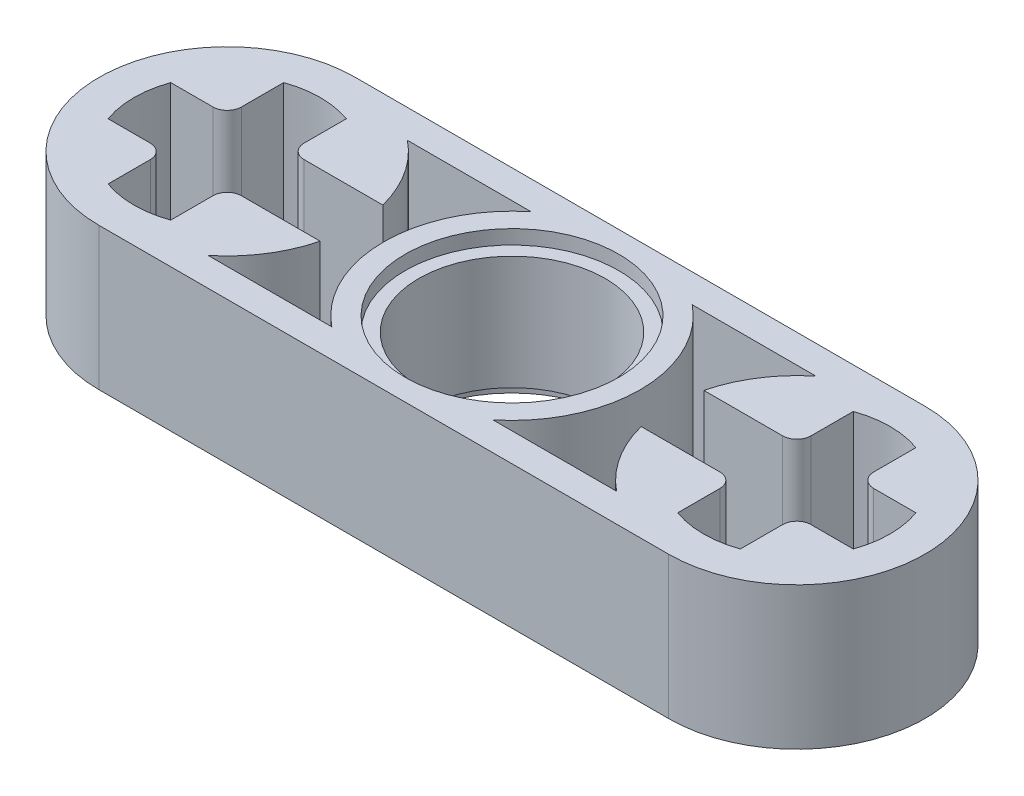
ISO-10303-21;
HEADER;
FILE_DESCRIPTION(('STEP AP214'),'2;1');
FILE_NAME('part.step','',(''),(''),'','','');
FILE_SCHEMA(('AUTOMOTIVE_DESIGN { 1 0 10303 214 1 1 1 1 }'));
ENDSEC;
DATA;
#1=APPLICATION_CONTEXT('core data for automotive mechanical design processes');
#2=APPLICATION_PROTOCOL_DEFINITION('international standard','automotive_design',2000,#1);
#3=PRODUCT_CONTEXT('',#1,'mechanical');
#4=PRODUCT('Part','Part','',(#3));
#5=PRODUCT_RELATED_PRODUCT_CATEGORY('part','',(#4));
#6=PRODUCT_DEFINITION_FORMATION('','',#4);
#7=PRODUCT_DEFINITION_CONTEXT('part definition',#1,'design');
#8=PRODUCT_DEFINITION('design','',#6,#7);
#9=PRODUCT_DEFINITION_SHAPE('','',#8);
#10=(LENGTH_UNIT() NAMED_UNIT(*) SI_UNIT(.MILLI.,.METRE.));
#11=(NAMED_UNIT(*) PLANE_ANGLE_UNIT() SI_UNIT($,.RADIAN.));
#12=(NAMED_UNIT(*) SI_UNIT($,.STERADIAN.) SOLID_ANGLE_UNIT());
#13=UNCERTAINTY_MEASURE_WITH_UNIT(LENGTH_MEASURE(1.E-05),#10,'distance_accuracy_value','');
#14=(GEOMETRIC_REPRESENTATION_CONTEXT(3) GLOBAL_UNCERTAINTY_ASSIGNED_CONTEXT((#13)) GLOBAL_UNIT_ASSIGNED_CONTEXT((#10,
#11,#12)) REPRESENTATION_CONTEXT('',''));
#15=CARTESIAN_POINT('',(0.,0.,0.));
#16=DIRECTION('',(0.,0.,1.));
#17=DIRECTION('',(1.,0.,0.));
#18=AXIS2_PLACEMENT_3D('',#15,#16,#17);
#19=CARTESIAN_POINT('',(8.,4.,0.));
#20=DIRECTION('',(0.,-1.,0.));
#21=DIRECTION('',(0.,0.,-1.));
#22=AXIS2_PLACEMENT_3D('',#19,#20,#21);
#23=CYLINDRICAL_SURFACE('',#22,2.61817525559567);
#24=CARTESIAN_POINT('',(8.,4.,0.));
#25=DIRECTION('',(0.,-1.,0.));
#26=DIRECTION('',(0.,0.,-1.));
#27=AXIS2_PLACEMENT_3D('',#24,#25,#26);
#28=CIRCLE('',#27,2.61817525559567);
#29=CARTESIAN_POINT('',(7.12,4.,-2.46585515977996));
#30=VERTEX_POINT('',#29);
#31=CARTESIAN_POINT('',(8.88,4.,-2.46585515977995));
#32=VERTEX_POINT('',#31);
#33=EDGE_CURVE('E294',#30,#32,#28,.T.);
#34=ORIENTED_EDGE('',*,*,#33,.F.);
#35=DIRECTION('',(0.,1.,0.));
#36=VECTOR('',#35,1.);
#37=CARTESIAN_POINT('',(7.12,4.,-2.46585515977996));
#38=LINE('',#37,#36);
#39=CARTESIAN_POINT('',(7.12,0.,-2.46585515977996));
#40=VERTEX_POINT('',#39);
#41=EDGE_CURVE('E304',#40,#30,#38,.T.);
#42=ORIENTED_EDGE('',*,*,#41,.F.);
#43=CARTESIAN_POINT('',(8.,0.,0.));
#44=DIRECTION('',(0.,-1.,0.));
#45=DIRECTION('',(0.,0.,-1.));
#46=AXIS2_PLACEMENT_3D('',#43,#44,#45);
#47=CIRCLE('',#46,2.61817525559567);
#48=CARTESIAN_POINT('',(8.88,0.,-2.46585515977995));
#49=VERTEX_POINT('',#48);
#50=EDGE_CURVE('E19',#49,#40,#47,.F.);
#51=ORIENTED_EDGE('',*,*,#50,.F.);
#52=DIRECTION('',(0.,1.,0.));
#53=VECTOR('',#52,1.);
#54=CARTESIAN_POINT('',(8.88,4.,-2.46585515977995));
#55=LINE('',#54,#53);
#56=EDGE_CURVE('E301',#32,#49,#55,.F.);
#57=ORIENTED_EDGE('',*,*,#56,.F.);
#58=EDGE_LOOP('',(#34,#42,#51,#57));
#59=FACE_BOUND('',#58,.T.);
#60=ADVANCED_FACE('F16',(#59),#23,.F.);
#61=CARTESIAN_POINT('',(8.88,4.,-1.28));
#62=DIRECTION('',(-1.,0.,0.));
#63=DIRECTION('',(0.,0.,1.));
#64=AXIS2_PLACEMENT_3D('',#61,#62,#63);
#65=PLANE('',#64);
#66=DIRECTION('',(0.,0.,1.));
#67=VECTOR('',#66,1.);
#68=CARTESIAN_POINT('',(8.88,4.,-1.28));
#69=LINE('',#68,#67);
#70=CARTESIAN_POINT('',(8.88,4.,-1.28));
#71=VERTEX_POINT('',#70);
#72=EDGE_CURVE('E316',#71,#32,#69,.F.);
#73=ORIENTED_EDGE('',*,*,#72,.T.);
#74=ORIENTED_EDGE('',*,*,#56,.T.);
#75=DIRECTION('',(0.,0.,1.));
#76=VECTOR('',#75,1.);
#77=CARTESIAN_POINT('',(8.88,0.,-1.28));
#78=LINE('',#77,#76);
#79=CARTESIAN_POINT('',(8.88,0.,-1.28));
#80=VERTEX_POINT('',#79);
#81=EDGE_CURVE('E308',#49,#80,#78,.T.);
#82=ORIENTED_EDGE('',*,*,#81,.T.);
#83=DIRECTION('',(0.,-1.,0.));
#84=VECTOR('',#83,1.);
#85=CARTESIAN_POINT('',(8.88,4.,-1.28));
#86=LINE('',#85,#84);
#87=EDGE_CURVE('E492',#71,#80,#86,.T.);
#88=ORIENTED_EDGE('',*,*,#87,.F.);
#89=EDGE_LOOP('',(#73,#74,#82,#88));
#90=FACE_BOUND('',#89,.T.);
#91=ADVANCED_FACE('F318',(#90),#65,.T.);
#92=CARTESIAN_POINT('',(-8.88,4.,-2.46585515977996));
#93=DIRECTION('',(1.,0.,0.));
#94=DIRECTION('',(0.,0.,-1.));
#95=AXIS2_PLACEMENT_3D('',#92,#93,#94);
#96=PLANE('',#95);
#97=DIRECTION('',(0.,0.,-1.));
#98=VECTOR('',#97,1.);
#99=CARTESIAN_POINT('',(-8.88,4.,-2.46585515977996));
#100=LINE('',#99,#98);
#101=CARTESIAN_POINT('',(-8.88,4.,-2.46585515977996));
#102=VERTEX_POINT('',#101);
#103=CARTESIAN_POINT('',(-8.88,4.,-1.28));
#104=VERTEX_POINT('',#103);
#105=EDGE_CURVE('E502',#102,#104,#100,.F.);
#106=ORIENTED_EDGE('',*,*,#105,.T.);
#107=DIRECTION('',(0.,-1.,0.));
#108=VECTOR('',#107,1.);
#109=CARTESIAN_POINT('',(-8.88,4.,-1.28));
#110=LINE('',#109,#108);
#111=CARTESIAN_POINT('',(-8.88,0.,-1.28));
#112=VERTEX_POINT('',#111);
#113=EDGE_CURVE('E477',#112,#104,#110,.F.);
#114=ORIENTED_EDGE('',*,*,#113,.F.);
#115=DIRECTION('',(0.,0.,-1.));
#116=VECTOR('',#115,1.);
#117=CARTESIAN_POINT('',(-8.88,0.,-2.46585515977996));
#118=LINE('',#117,#116);
#119=CARTESIAN_POINT('',(-8.88,0.,-2.46585515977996));
#120=VERTEX_POINT('',#119);
#121=EDGE_CURVE('E319',#112,#120,#118,.T.);
#122=ORIENTED_EDGE('',*,*,#121,.T.);
#123=DIRECTION('',(0.,1.,0.));
#124=VECTOR('',#123,1.);
#125=CARTESIAN_POINT('',(-8.88,4.,-2.46585515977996));
#126=LINE('',#125,#124);
#127=EDGE_CURVE('E322',#120,#102,#126,.T.);
#128=ORIENTED_EDGE('',*,*,#127,.T.);
#129=EDGE_LOOP('',(#106,#114,#122,#128));
#130=FACE_BOUND('',#129,.T.);
#131=ADVANCED_FACE('F1158',(#130),#96,.T.);
#132=CARTESIAN_POINT('',(-8.,4.,0.));
#133=DIRECTION('',(0.,-1.,0.));
#134=DIRECTION('',(0.,0.,-1.));
#135=AXIS2_PLACEMENT_3D('',#132,#133,#134);
#136=CYLINDRICAL_SURFACE('',#135,2.61817525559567);
#137=CARTESIAN_POINT('',(-8.,4.,0.));
#138=DIRECTION('',(0.,-1.,0.));
#139=DIRECTION('',(0.,0.,-1.));
#140=AXIS2_PLACEMENT_3D('',#137,#138,#139);
#141=CIRCLE('',#140,2.61817525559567);
#142=CARTESIAN_POINT('',(-7.12,4.,-2.46585515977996));
#143=VERTEX_POINT('',#142);
#144=EDGE_CURVE('E498',#102,#143,#141,.T.);
#145=ORIENTED_EDGE('',*,*,#144,.F.);
#146=ORIENTED_EDGE('',*,*,#127,.F.);
#147=CARTESIAN_POINT('',(-8.,0.,0.));
#148=DIRECTION('',(0.,-1.,0.));
#149=DIRECTION('',(0.,0.,-1.));
#150=AXIS2_PLACEMENT_3D('',#147,#148,#149);
#151=CIRCLE('',#150,2.61817525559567);
#152=CARTESIAN_POINT('',(-7.12,0.,-2.46585515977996));
#153=VERTEX_POINT('',#152);
#154=EDGE_CURVE('E501',#153,#120,#151,.F.);
#155=ORIENTED_EDGE('',*,*,#154,.F.);
#156=DIRECTION('',(0.,1.,0.));
#157=VECTOR('',#156,1.);
#158=CARTESIAN_POINT('',(-7.12,4.,-2.46585515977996));
#159=LINE('',#158,#157);
#160=EDGE_CURVE('E473',#143,#153,#159,.F.);
#161=ORIENTED_EDGE('',*,*,#160,.F.);
#162=EDGE_LOOP('',(#145,#146,#155,#161));
#163=FACE_BOUND('',#162,.T.);
#164=ADVANCED_FACE('F1148',(#163),#136,.F.);
#165=CARTESIAN_POINT('',(0.,0.4,0.));
#166=DIRECTION('',(0.,-1.,0.));
#167=DIRECTION('',(0.,0.,-1.));
#168=AXIS2_PLACEMENT_3D('',#165,#166,#167);
#169=PLANE('',#168);
#170=CARTESIAN_POINT('',(0.,0.4,0.));
#171=DIRECTION('',(0.,-1.,0.));
#172=DIRECTION('',(0.,0.,-1.));
#173=AXIS2_PLACEMENT_3D('',#170,#171,#172);
#174=CIRCLE('',#173,3.);
#175=CARTESIAN_POINT('',(0.,0.4,-3.));
#176=VERTEX_POINT('',#175);
#177=EDGE_CURVE('E470',#176,#176,#174,.T.);
#178=ORIENTED_EDGE('',*,*,#177,.T.);
#179=EDGE_LOOP('',(#178));
#180=FACE_BOUND('',#179,.T.);
#181=CARTESIAN_POINT('',(0.,0.4,0.));
#182=DIRECTION('',(0.,-1.,0.));
#183=DIRECTION('',(0.,0.,-1.));
#184=AXIS2_PLACEMENT_3D('',#181,#182,#183);
#185=CIRCLE('',#184,2.61817525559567);
#186=CARTESIAN_POINT('',(0.,0.4,-2.61817525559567));
#187=VERTEX_POINT('',#186);
#188=EDGE_CURVE('E485',#187,#187,#185,.F.);
#189=ORIENTED_EDGE('',*,*,#188,.T.);
#190=EDGE_LOOP('',(#189));
#191=FACE_BOUND('',#190,.T.);
#192=ADVANCED_FACE('F1139',(#180,#191),#169,.T.);
#193=CARTESIAN_POINT('',(7.12,4.,-2.46585515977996));
#194=DIRECTION('',(1.,0.,0.));
#195=DIRECTION('',(0.,0.,-1.));
#196=AXIS2_PLACEMENT_3D('',#193,#194,#195);
#197=PLANE('',#196);
#198=DIRECTION('',(0.,0.,-1.));
#199=VECTOR('',#198,1.);
#200=CARTESIAN_POINT('',(7.12,4.,-2.46585515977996));
#201=LINE('',#200,#199);
#202=CARTESIAN_POINT('',(7.12,4.,-1.28));
#203=VERTEX_POINT('',#202);
#204=EDGE_CURVE('E497',#30,#203,#201,.F.);
#205=ORIENTED_EDGE('',*,*,#204,.T.);
#206=DIRECTION('',(0.,-1.,0.));
#207=VECTOR('',#206,1.);
#208=CARTESIAN_POINT('',(7.12,4.,-1.28));
#209=LINE('',#208,#207);
#210=CARTESIAN_POINT('',(7.12,0.,-1.28));
#211=VERTEX_POINT('',#210);
#212=EDGE_CURVE('E469',#211,#203,#209,.F.);
#213=ORIENTED_EDGE('',*,*,#212,.F.);
#214=DIRECTION('',(0.,0.,-1.));
#215=VECTOR('',#214,1.);
#216=CARTESIAN_POINT('',(7.12,0.,-2.46585515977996));
#217=LINE('',#216,#215);
#218=EDGE_CURVE('E500',#211,#40,#217,.T.);
#219=ORIENTED_EDGE('',*,*,#218,.T.);
#220=ORIENTED_EDGE('',*,*,#41,.T.);
#221=EDGE_LOOP('',(#205,#213,#219,#220));
#222=FACE_BOUND('',#221,.T.);
#223=ADVANCED_FACE('F1129',(#222),#197,.T.);
#224=CARTESIAN_POINT('',(9.28,4.,-1.28));
#225=DIRECTION('',(0.,-1.,0.));
#226=DIRECTION('',(0.,0.,-1.));
#227=AXIS2_PLACEMENT_3D('',#224,#225,#226);
#228=CYLINDRICAL_SURFACE('',#227,0.4);
#229=CARTESIAN_POINT('',(9.28,4.,-1.28));
#230=DIRECTION('',(0.,-1.,0.));
#231=DIRECTION('',(0.,0.,-1.));
#232=AXIS2_PLACEMENT_3D('',#229,#230,#231);
#233=CIRCLE('',#232,0.4);
#234=CARTESIAN_POINT('',(9.28,4.,-0.88));
#235=VERTEX_POINT('',#234);
#236=EDGE_CURVE('E493',#235,#71,#233,.T.);
#237=ORIENTED_EDGE('',*,*,#236,.T.);
#238=ORIENTED_EDGE('',*,*,#87,.T.);
#239=CARTESIAN_POINT('',(9.28,0.,-1.28));
#240=DIRECTION('',(0.,-1.,0.));
#241=DIRECTION('',(0.,0.,-1.));
#242=AXIS2_PLACEMENT_3D('',#239,#240,#241);
#243=CIRCLE('',#242,0.4);
#244=CARTESIAN_POINT('',(9.28,0.,-0.88));
#245=VERTEX_POINT('',#244);
#246=EDGE_CURVE('E312',#80,#245,#243,.F.);
#247=ORIENTED_EDGE('',*,*,#246,.T.);
#248=DIRECTION('',(0.,1.,0.));
#249=VECTOR('',#248,1.);
#250=CARTESIAN_POINT('',(9.28,4.,-0.88));
#251=LINE('',#250,#249);
#252=EDGE_CURVE('E531',#235,#245,#251,.F.);
#253=ORIENTED_EDGE('',*,*,#252,.F.);
#254=EDGE_LOOP('',(#237,#238,#247,#253));
#255=FACE_BOUND('',#254,.T.);
#256=ADVANCED_FACE('F1119',(#255),#228,.T.);
#257=CARTESIAN_POINT('',(9.28,4.,1.28));
#258=DIRECTION('',(0.,-1.,0.));
#259=DIRECTION('',(0.,0.,-1.));
#260=AXIS2_PLACEMENT_3D('',#257,#258,#259);
#261=CYLINDRICAL_SURFACE('',#260,0.4);
#262=CARTESIAN_POINT('',(9.28,4.,1.28));
#263=DIRECTION('',(0.,-1.,0.));
#264=DIRECTION('',(0.,0.,-1.));
#265=AXIS2_PLACEMENT_3D('',#262,#263,#264);
#266=CIRCLE('',#265,0.4);
#267=CARTESIAN_POINT('',(8.88,4.,1.28));
#268=VERTEX_POINT('',#267);
#269=CARTESIAN_POINT('',(9.28,4.,0.88));
#270=VERTEX_POINT('',#269);
#271=EDGE_CURVE('E488',#268,#270,#266,.T.);
#272=ORIENTED_EDGE('',*,*,#271,.T.);
#273=DIRECTION('',(0.,1.,0.));
#274=VECTOR('',#273,1.);
#275=CARTESIAN_POINT('',(9.28,4.,0.88));
#276=LINE('',#275,#274);
#277=CARTESIAN_POINT('',(9.28,0.,0.88));
#278=VERTEX_POINT('',#277);
#279=EDGE_CURVE('E534',#278,#270,#276,.T.);
#280=ORIENTED_EDGE('',*,*,#279,.F.);
#281=CARTESIAN_POINT('',(9.28,0.,1.28));
#282=DIRECTION('',(0.,-1.,0.));
#283=DIRECTION('',(0.,0.,-1.));
#284=AXIS2_PLACEMENT_3D('',#281,#282,#283);
#285=CIRCLE('',#284,0.4);
#286=CARTESIAN_POINT('',(8.88,0.,1.28));
#287=VERTEX_POINT('',#286);
#288=EDGE_CURVE('E490',#278,#287,#285,.F.);
#289=ORIENTED_EDGE('',*,*,#288,.T.);
#290=DIRECTION('',(0.,1.,0.));
#291=VECTOR('',#290,1.);
#292=CARTESIAN_POINT('',(8.88,4.,1.28));
#293=LINE('',#292,#291);
#294=EDGE_CURVE('E538',#268,#287,#293,.F.);
#295=ORIENTED_EDGE('',*,*,#294,.F.);
#296=EDGE_LOOP('',(#272,#280,#289,#295));
#297=FACE_BOUND('',#296,.T.);
#298=ADVANCED_FACE('F1109',(#297),#261,.T.);
#299=CARTESIAN_POINT('',(0.,4.,0.));
#300=DIRECTION('',(0.,-1.,0.));
#301=DIRECTION('',(0.,0.,-1.));
#302=AXIS2_PLACEMENT_3D('',#299,#300,#301);
#303=CYLINDRICAL_SURFACE('',#302,2.61817525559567);
#304=CARTESIAN_POINT('',(0.,3.6,0.));
#305=DIRECTION('',(0.,-1.,0.));
#306=DIRECTION('',(0.,0.,-1.));
#307=AXIS2_PLACEMENT_3D('',#304,#305,#306);
#308=CIRCLE('',#307,2.61817525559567);
#309=CARTESIAN_POINT('',(0.,3.6,-2.61817525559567));
#310=VERTEX_POINT('',#309);
#311=EDGE_CURVE('E458',#310,#310,#308,.T.);
#312=ORIENTED_EDGE('',*,*,#311,.F.);
#313=EDGE_LOOP('',(#312));
#314=FACE_BOUND('',#313,.T.);
#315=ORIENTED_EDGE('',*,*,#188,.F.);
#316=EDGE_LOOP('',(#315));
#317=FACE_BOUND('',#316,.T.);
#318=ADVANCED_FACE('F1099',(#314,#317),#303,.F.);
#319=CARTESIAN_POINT('',(-9.28,4.,1.28));
#320=DIRECTION('',(0.,-1.,0.));
#321=DIRECTION('',(0.,0.,-1.));
#322=AXIS2_PLACEMENT_3D('',#319,#320,#321);
#323=CYLINDRICAL_SURFACE('',#322,0.4);
#324=CARTESIAN_POINT('',(-9.28,4.,1.28));
#325=DIRECTION('',(0.,-1.,0.));
#326=DIRECTION('',(0.,0.,-1.));
#327=AXIS2_PLACEMENT_3D('',#324,#325,#326);
#328=CIRCLE('',#327,0.4);
#329=CARTESIAN_POINT('',(-9.28,4.,0.88));
#330=VERTEX_POINT('',#329);
#331=CARTESIAN_POINT('',(-8.88,4.,1.28));
#332=VERTEX_POINT('',#331);
#333=EDGE_CURVE('E481',#330,#332,#328,.T.);
#334=ORIENTED_EDGE('',*,*,#333,.T.);
#335=DIRECTION('',(0.,1.,0.));
#336=VECTOR('',#335,1.);
#337=CARTESIAN_POINT('',(-8.88,4.,1.28));
#338=LINE('',#337,#336);
#339=CARTESIAN_POINT('',(-8.88,0.,1.28));
#340=VERTEX_POINT('',#339);
#341=EDGE_CURVE('E547',#340,#332,#338,.T.);
#342=ORIENTED_EDGE('',*,*,#341,.F.);
#343=CARTESIAN_POINT('',(-9.28,0.,1.28));
#344=DIRECTION('',(0.,-1.,0.));
#345=DIRECTION('',(0.,0.,-1.));
#346=AXIS2_PLACEMENT_3D('',#343,#344,#345);
#347=CIRCLE('',#346,0.4);
#348=CARTESIAN_POINT('',(-9.28,0.,0.88));
#349=VERTEX_POINT('',#348);
#350=EDGE_CURVE('E483',#340,#349,#347,.F.);
#351=ORIENTED_EDGE('',*,*,#350,.T.);
#352=DIRECTION('',(0.,1.,0.));
#353=VECTOR('',#352,1.);
#354=CARTESIAN_POINT('',(-9.28,4.,0.88));
#355=LINE('',#354,#353);
#356=EDGE_CURVE('E551',#330,#349,#355,.F.);
#357=ORIENTED_EDGE('',*,*,#356,.F.);
#358=EDGE_LOOP('',(#334,#342,#351,#357));
#359=FACE_BOUND('',#358,.T.);
#360=ADVANCED_FACE('F1089',(#359),#323,.T.);
#361=CARTESIAN_POINT('',(-9.28,4.,-1.28));
#362=DIRECTION('',(0.,-1.,0.));
#363=DIRECTION('',(0.,0.,-1.));
#364=AXIS2_PLACEMENT_3D('',#361,#362,#363);
#365=CYLINDRICAL_SURFACE('',#364,0.4);
#366=CARTESIAN_POINT('',(-9.28,4.,-1.28));
#367=DIRECTION('',(0.,-1.,0.));
#368=DIRECTION('',(0.,0.,-1.));
#369=AXIS2_PLACEMENT_3D('',#366,#367,#368);
#370=CIRCLE('',#369,0.4);
#371=CARTESIAN_POINT('',(-9.28,4.,-0.88));
#372=VERTEX_POINT('',#371);
#373=EDGE_CURVE('E474',#104,#372,#370,.T.);
#374=ORIENTED_EDGE('',*,*,#373,.T.);
#375=DIRECTION('',(0.,1.,0.));
#376=VECTOR('',#375,1.);
#377=CARTESIAN_POINT('',(-9.28,4.,-0.88));
#378=LINE('',#377,#376);
#379=CARTESIAN_POINT('',(-9.28,0.,-0.88));
#380=VERTEX_POINT('',#379);
#381=EDGE_CURVE('E554',#380,#372,#378,.T.);
#382=ORIENTED_EDGE('',*,*,#381,.F.);
#383=CARTESIAN_POINT('',(-9.28,0.,-1.28));
#384=DIRECTION('',(0.,-1.,0.));
#385=DIRECTION('',(0.,0.,-1.));
#386=AXIS2_PLACEMENT_3D('',#383,#384,#385);
#387=CIRCLE('',#386,0.4);
#388=EDGE_CURVE('E478',#380,#112,#387,.F.);
#389=ORIENTED_EDGE('',*,*,#388,.T.);
#390=ORIENTED_EDGE('',*,*,#113,.T.);
#391=EDGE_LOOP('',(#374,#382,#389,#390));
#392=FACE_BOUND('',#391,.T.);
#393=ADVANCED_FACE('F1080',(#392),#365,.T.);
#394=CARTESIAN_POINT('',(-7.12,4.,-2.46585515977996));
#395=DIRECTION('',(-1.,0.,0.));
#396=DIRECTION('',(0.,0.,1.));
#397=AXIS2_PLACEMENT_3D('',#394,#395,#396);
#398=PLANE('',#397);
#399=DIRECTION('',(0.,0.,1.));
#400=VECTOR('',#399,1.);
#401=CARTESIAN_POINT('',(-7.12,4.,-2.46585515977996));
#402=LINE('',#401,#400);
#403=CARTESIAN_POINT('',(-7.12,4.,-1.28));
#404=VERTEX_POINT('',#403);
#405=EDGE_CURVE('E520',#404,#143,#402,.F.);
#406=ORIENTED_EDGE('',*,*,#405,.T.);
#407=ORIENTED_EDGE('',*,*,#160,.T.);
#408=DIRECTION('',(0.,0.,1.));
#409=VECTOR('',#408,1.);
#410=CARTESIAN_POINT('',(-7.12,0.,-2.46585515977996));
#411=LINE('',#410,#409);
#412=CARTESIAN_POINT('',(-7.12,0.,-1.28));
#413=VERTEX_POINT('',#412);
#414=EDGE_CURVE('E476',#153,#413,#411,.T.);
#415=ORIENTED_EDGE('',*,*,#414,.T.);
#416=DIRECTION('',(0.,-1.,0.));
#417=VECTOR('',#416,1.);
#418=CARTESIAN_POINT('',(-7.12,4.,-1.28));
#419=LINE('',#418,#417);
#420=EDGE_CURVE('E450',#404,#413,#419,.T.);
#421=ORIENTED_EDGE('',*,*,#420,.F.);
#422=EDGE_LOOP('',(#406,#407,#415,#421));
#423=FACE_BOUND('',#422,.T.);
#424=ADVANCED_FACE('F1070',(#423),#398,.T.);
#425=CARTESIAN_POINT('',(0.,0.4,0.));
#426=DIRECTION('',(0.,-1.,0.));
#427=DIRECTION('',(0.,0.,-1.));
#428=AXIS2_PLACEMENT_3D('',#425,#426,#427);
#429=CYLINDRICAL_SURFACE('',#428,3.);
#430=ORIENTED_EDGE('',*,*,#177,.F.);
#431=EDGE_LOOP('',(#430));
#432=FACE_BOUND('',#431,.T.);
#433=CARTESIAN_POINT('',(0.,0.,0.));
#434=DIRECTION('',(0.,-1.,0.));
#435=DIRECTION('',(0.,0.,-1.));
#436=AXIS2_PLACEMENT_3D('',#433,#434,#435);
#437=CIRCLE('',#436,3.);
#438=CARTESIAN_POINT('',(0.,0.,-3.));
#439=VERTEX_POINT('',#438);
#440=EDGE_CURVE('E447',#439,#439,#437,.T.);
#441=ORIENTED_EDGE('',*,*,#440,.T.);
#442=EDGE_LOOP('',(#441));
#443=FACE_BOUND('',#442,.T.);
#444=ADVANCED_FACE('F1060',(#432,#443),#429,.F.);
#445=CARTESIAN_POINT('',(6.72,4.,-1.28));
#446=DIRECTION('',(0.,-1.,0.));
#447=DIRECTION('',(0.,0.,-1.));
#448=AXIS2_PLACEMENT_3D('',#445,#446,#447);
#449=CYLINDRICAL_SURFACE('',#448,0.4);
#450=CARTESIAN_POINT('',(6.72,4.,-1.28));
#451=DIRECTION('',(0.,-1.,0.));
#452=DIRECTION('',(0.,0.,-1.));
#453=AXIS2_PLACEMENT_3D('',#450,#451,#452);
#454=CIRCLE('',#453,0.4);
#455=CARTESIAN_POINT('',(6.72,4.,-0.88));
#456=VERTEX_POINT('',#455);
#457=EDGE_CURVE('E466',#203,#456,#454,.T.);
#458=ORIENTED_EDGE('',*,*,#457,.T.);
#459=DIRECTION('',(0.,1.,0.));
#460=VECTOR('',#459,1.);
#461=CARTESIAN_POINT('',(6.72,4.,-0.88));
#462=LINE('',#461,#460);
#463=CARTESIAN_POINT('',(6.72,0.,-0.88));
#464=VERTEX_POINT('',#463);
#465=EDGE_CURVE('E561',#464,#456,#462,.T.);
#466=ORIENTED_EDGE('',*,*,#465,.F.);
#467=CARTESIAN_POINT('',(6.72,0.,-1.28));
#468=DIRECTION('',(0.,-1.,0.));
#469=DIRECTION('',(0.,0.,-1.));
#470=AXIS2_PLACEMENT_3D('',#467,#468,#469);
#471=CIRCLE('',#470,0.4);
#472=EDGE_CURVE('E443',#464,#211,#471,.F.);
#473=ORIENTED_EDGE('',*,*,#472,.T.);
#474=ORIENTED_EDGE('',*,*,#212,.T.);
#475=EDGE_LOOP('',(#458,#466,#473,#474));
#476=FACE_BOUND('',#475,.T.);
#477=ADVANCED_FACE('F1050',(#476),#449,.T.);
#478=CARTESIAN_POINT('',(9.28,4.,-0.88));
#479=DIRECTION('',(0.,0.,1.));
#480=DIRECTION('',(1.,0.,0.));
#481=AXIS2_PLACEMENT_3D('',#478,#479,#480);
#482=PLANE('',#481);
#483=DIRECTION('',(1.,0.,0.));
#484=VECTOR('',#483,1.);
#485=CARTESIAN_POINT('',(9.28,4.,-0.88));
#486=LINE('',#485,#484);
#487=CARTESIAN_POINT('',(10.46585515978,4.,-0.88));
#488=VERTEX_POINT('',#487);
#489=EDGE_CURVE('E468',#488,#235,#486,.F.);
#490=ORIENTED_EDGE('',*,*,#489,.T.);
#491=ORIENTED_EDGE('',*,*,#252,.T.);
#492=DIRECTION('',(1.,0.,0.));
#493=VECTOR('',#492,1.);
#494=CARTESIAN_POINT('',(-8.,0.,-0.88));
#495=LINE('',#494,#493);
#496=CARTESIAN_POINT('',(10.46585515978,0.,-0.88));
#497=VERTEX_POINT('',#496);
#498=EDGE_CURVE('E446',#245,#497,#495,.T.);
#499=ORIENTED_EDGE('',*,*,#498,.T.);
#500=DIRECTION('',(0.,-1.,0.));
#501=VECTOR('',#500,1.);
#502=CARTESIAN_POINT('',(10.46585515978,4.,-0.880000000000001));
#503=LINE('',#502,#501);
#504=EDGE_CURVE('E614',#497,#488,#503,.F.);
#505=ORIENTED_EDGE('',*,*,#504,.T.);
#506=EDGE_LOOP('',(#490,#491,#499,#505));
#507=FACE_BOUND('',#506,.T.);
#508=ADVANCED_FACE('F1040',(#507),#482,.T.);
#509=CARTESIAN_POINT('',(9.28,4.,0.88));
#510=DIRECTION('',(0.,0.,-1.));
#511=DIRECTION('',(-1.,0.,0.));
#512=AXIS2_PLACEMENT_3D('',#509,#510,#511);
#513=PLANE('',#512);
#514=DIRECTION('',(-1.,0.,0.));
#515=VECTOR('',#514,1.);
#516=CARTESIAN_POINT('',(9.28,4.,0.88));
#517=LINE('',#516,#515);
#518=CARTESIAN_POINT('',(10.46585515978,4.,0.88));
#519=VERTEX_POINT('',#518);
#520=EDGE_CURVE('E537',#270,#519,#517,.F.);
#521=ORIENTED_EDGE('',*,*,#520,.T.);
#522=DIRECTION('',(0.,-1.,0.));
#523=VECTOR('',#522,1.);
#524=CARTESIAN_POINT('',(10.46585515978,4.,0.88));
#525=LINE('',#524,#523);
#526=CARTESIAN_POINT('',(10.46585515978,0.,0.88));
#527=VERTEX_POINT('',#526);
#528=EDGE_CURVE('E429',#519,#527,#525,.T.);
#529=ORIENTED_EDGE('',*,*,#528,.T.);
#530=DIRECTION('',(1.,0.,0.));
#531=VECTOR('',#530,1.);
#532=CARTESIAN_POINT('',(-8.,0.,0.88));
#533=LINE('',#532,#531);
#534=EDGE_CURVE('E593',#527,#278,#533,.F.);
#535=ORIENTED_EDGE('',*,*,#534,.T.);
#536=ORIENTED_EDGE('',*,*,#279,.T.);
#537=EDGE_LOOP('',(#521,#529,#535,#536));
#538=FACE_BOUND('',#537,.T.);
#539=ADVANCED_FACE('F1030',(#538),#513,.T.);
#540=CARTESIAN_POINT('',(8.88,4.,2.46585515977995));
#541=DIRECTION('',(-1.,0.,0.));
#542=DIRECTION('',(0.,0.,1.));
#543=AXIS2_PLACEMENT_3D('',#540,#541,#542);
#544=PLANE('',#543);
#545=DIRECTION('',(0.,0.,1.));
#546=VECTOR('',#545,1.);
#547=CARTESIAN_POINT('',(8.88,4.,2.46585515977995));
#548=LINE('',#547,#546);
#549=CARTESIAN_POINT('',(8.88,4.,2.46585515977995));
#550=VERTEX_POINT('',#549);
#551=EDGE_CURVE('E541',#550,#268,#548,.F.);
#552=ORIENTED_EDGE('',*,*,#551,.T.);
#553=ORIENTED_EDGE('',*,*,#294,.T.);
#554=DIRECTION('',(0.,0.,1.));
#555=VECTOR('',#554,1.);
#556=CARTESIAN_POINT('',(8.88,0.,0.));
#557=LINE('',#556,#555);
#558=CARTESIAN_POINT('',(8.88,0.,2.46585515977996));
#559=VERTEX_POINT('',#558);
#560=EDGE_CURVE('E596',#287,#559,#557,.T.);
#561=ORIENTED_EDGE('',*,*,#560,.T.);
#562=DIRECTION('',(0.,-1.,0.));
#563=VECTOR('',#562,1.);
#564=CARTESIAN_POINT('',(8.88,4.,2.46585515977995));
#565=LINE('',#564,#563);
#566=EDGE_CURVE('E428',#559,#550,#565,.F.);
#567=ORIENTED_EDGE('',*,*,#566,.T.);
#568=EDGE_LOOP('',(#552,#553,#561,#567));
#569=FACE_BOUND('',#568,.T.);
#570=ADVANCED_FACE('F1020',(#569),#544,.T.);
#571=CARTESIAN_POINT('',(7.12,4.,1.28));
#572=DIRECTION('',(1.,0.,0.));
#573=DIRECTION('',(0.,0.,-1.));
#574=AXIS2_PLACEMENT_3D('',#571,#572,#573);
#575=PLANE('',#574);
#576=DIRECTION('',(0.,0.,-1.));
#577=VECTOR('',#576,1.);
#578=CARTESIAN_POINT('',(7.12,4.,1.28));
#579=LINE('',#578,#577);
#580=CARTESIAN_POINT('',(7.12,4.,1.28));
#581=VERTEX_POINT('',#580);
#582=CARTESIAN_POINT('',(7.12,4.,2.46585515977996));
#583=VERTEX_POINT('',#582);
#584=EDGE_CURVE('E465',#581,#583,#579,.F.);
#585=ORIENTED_EDGE('',*,*,#584,.T.);
#586=DIRECTION('',(0.,-1.,0.));
#587=VECTOR('',#586,1.);
#588=CARTESIAN_POINT('',(7.12,4.,2.46585515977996));
#589=LINE('',#588,#587);
#590=CARTESIAN_POINT('',(7.12,0.,2.46585515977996));
#591=VERTEX_POINT('',#590);
#592=EDGE_CURVE('E424',#583,#591,#589,.T.);
#593=ORIENTED_EDGE('',*,*,#592,.T.);
#594=DIRECTION('',(0.,0.,1.));
#595=VECTOR('',#594,1.);
#596=CARTESIAN_POINT('',(7.12,0.,0.));
#597=LINE('',#596,#595);
#598=CARTESIAN_POINT('',(7.12,0.,1.28));
#599=VERTEX_POINT('',#598);
#600=EDGE_CURVE('E442',#591,#599,#597,.F.);
#601=ORIENTED_EDGE('',*,*,#600,.T.);
#602=DIRECTION('',(0.,-1.,0.));
#603=VECTOR('',#602,1.);
#604=CARTESIAN_POINT('',(7.12,4.,1.28));
#605=LINE('',#604,#603);
#606=EDGE_CURVE('E461',#581,#599,#605,.T.);
#607=ORIENTED_EDGE('',*,*,#606,.F.);
#608=EDGE_LOOP('',(#585,#593,#601,#607));
#609=FACE_BOUND('',#608,.T.);
#610=ADVANCED_FACE('F1010',(#609),#575,.T.);
#611=CARTESIAN_POINT('',(6.72,4.,1.28));
#612=DIRECTION('',(0.,-1.,0.));
#613=DIRECTION('',(0.,0.,-1.));
#614=AXIS2_PLACEMENT_3D('',#611,#612,#613);
#615=CYLINDRICAL_SURFACE('',#614,0.4);
#616=CARTESIAN_POINT('',(6.72,4.,1.28));
#617=DIRECTION('',(0.,-1.,0.));
#618=DIRECTION('',(0.,0.,-1.));
#619=AXIS2_PLACEMENT_3D('',#616,#617,#618);
#620=CIRCLE('',#619,0.4);
#621=CARTESIAN_POINT('',(6.72,4.,0.88));
#622=VERTEX_POINT('',#621);
#623=EDGE_CURVE('E462',#622,#581,#620,.T.);
#624=ORIENTED_EDGE('',*,*,#623,.T.);
#625=ORIENTED_EDGE('',*,*,#606,.T.);
#626=CARTESIAN_POINT('',(6.72,0.,1.28));
#627=DIRECTION('',(0.,-1.,0.));
#628=DIRECTION('',(0.,0.,-1.));
#629=AXIS2_PLACEMENT_3D('',#626,#627,#628);
#630=CIRCLE('',#629,0.4);
#631=CARTESIAN_POINT('',(6.72,0.,0.88));
#632=VERTEX_POINT('',#631);
#633=EDGE_CURVE('E440',#599,#632,#630,.F.);
#634=ORIENTED_EDGE('',*,*,#633,.T.);
#635=DIRECTION('',(0.,1.,0.));
#636=VECTOR('',#635,1.);
#637=CARTESIAN_POINT('',(6.72,4.,0.88));
#638=LINE('',#637,#636);
#639=EDGE_CURVE('E569',#622,#632,#638,.F.);
#640=ORIENTED_EDGE('',*,*,#639,.F.);
#641=EDGE_LOOP('',(#624,#625,#634,#640));
#642=FACE_BOUND('',#641,.T.);
#643=ADVANCED_FACE('F1000',(#642),#615,.T.);
#644=CARTESIAN_POINT('',(0.,3.6,0.));
#645=DIRECTION('',(0.,1.,0.));
#646=DIRECTION('',(0.,0.,1.));
#647=AXIS2_PLACEMENT_3D('',#644,#645,#646);
#648=PLANE('',#647);
#649=CARTESIAN_POINT('',(0.,3.6,0.));
#650=DIRECTION('',(0.,1.,0.));
#651=DIRECTION('',(0.,0.,1.));
#652=AXIS2_PLACEMENT_3D('',#649,#650,#651);
#653=CIRCLE('',#652,3.);
#654=CARTESIAN_POINT('',(0.,3.6,3.));
#655=VERTEX_POINT('',#654);
#656=EDGE_CURVE('E406',#655,#655,#653,.T.);
#657=ORIENTED_EDGE('',*,*,#656,.T.);
#658=EDGE_LOOP('',(#657));
#659=FACE_BOUND('',#658,.T.);
#660=ORIENTED_EDGE('',*,*,#311,.T.);
#661=EDGE_LOOP('',(#660));
#662=FACE_BOUND('',#661,.T.);
#663=ADVANCED_FACE('F990',(#659,#662),#648,.T.);
#664=CARTESIAN_POINT('',(-6.72,4.,1.28));
#665=DIRECTION('',(0.,-1.,0.));
#666=DIRECTION('',(0.,0.,-1.));
#667=AXIS2_PLACEMENT_3D('',#664,#665,#666);
#668=CYLINDRICAL_SURFACE('',#667,0.4);
#669=CARTESIAN_POINT('',(-6.72,4.,1.28));
#670=DIRECTION('',(0.,-1.,0.));
#671=DIRECTION('',(0.,0.,-1.));
#672=AXIS2_PLACEMENT_3D('',#669,#670,#671);
#673=CIRCLE('',#672,0.4);
#674=CARTESIAN_POINT('',(-7.12,4.,1.28));
#675=VERTEX_POINT('',#674);
#676=CARTESIAN_POINT('',(-6.72,4.,0.880000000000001));
#677=VERTEX_POINT('',#676);
#678=EDGE_CURVE('E455',#675,#677,#673,.T.);
#679=ORIENTED_EDGE('',*,*,#678,.T.);
#680=DIRECTION('',(0.,1.,0.));
#681=VECTOR('',#680,1.);
#682=CARTESIAN_POINT('',(-6.72,4.,0.880000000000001));
#683=LINE('',#682,#681);
#684=CARTESIAN_POINT('',(-6.72,0.,0.880000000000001));
#685=VERTEX_POINT('',#684);
#686=EDGE_CURVE('E581',#685,#677,#683,.T.);
#687=ORIENTED_EDGE('',*,*,#686,.F.);
#688=CARTESIAN_POINT('',(-6.72,0.,1.28));
#689=DIRECTION('',(0.,-1.,0.));
#690=DIRECTION('',(0.,0.,-1.));
#691=AXIS2_PLACEMENT_3D('',#688,#689,#690);
#692=CIRCLE('',#691,0.4);
#693=CARTESIAN_POINT('',(-7.12,0.,1.28));
#694=VERTEX_POINT('',#693);
#695=EDGE_CURVE('E437',#685,#694,#692,.F.);
#696=ORIENTED_EDGE('',*,*,#695,.T.);
#697=DIRECTION('',(0.,1.,0.));
#698=VECTOR('',#697,1.);
#699=CARTESIAN_POINT('',(-7.12,4.,1.28));
#700=LINE('',#699,#698);
#701=EDGE_CURVE('E544',#675,#694,#700,.F.);
#702=ORIENTED_EDGE('',*,*,#701,.F.);
#703=EDGE_LOOP('',(#679,#687,#696,#702));
#704=FACE_BOUND('',#703,.T.);
#705=ADVANCED_FACE('F980',(#704),#668,.T.);
#706=CARTESIAN_POINT('',(-7.12,4.,1.28));
#707=DIRECTION('',(-1.,0.,0.));
#708=DIRECTION('',(0.,0.,1.));
#709=AXIS2_PLACEMENT_3D('',#706,#707,#708);
#710=PLANE('',#709);
#711=DIRECTION('',(0.,0.,1.));
#712=VECTOR('',#711,1.);
#713=CARTESIAN_POINT('',(-7.12,4.,1.28));
#714=LINE('',#713,#712);
#715=CARTESIAN_POINT('',(-7.12,4.,2.46585515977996));
#716=VERTEX_POINT('',#715);
#717=EDGE_CURVE('E457',#716,#675,#714,.F.);
#718=ORIENTED_EDGE('',*,*,#717,.T.);
#719=ORIENTED_EDGE('',*,*,#701,.T.);
#720=DIRECTION('',(0.,0.,1.));
#721=VECTOR('',#720,1.);
#722=CARTESIAN_POINT('',(-7.12,0.,0.));
#723=LINE('',#722,#721);
#724=CARTESIAN_POINT('',(-7.12,0.,2.46585515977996));
#725=VERTEX_POINT('',#724);
#726=EDGE_CURVE('E439',#694,#725,#723,.T.);
#727=ORIENTED_EDGE('',*,*,#726,.T.);
#728=DIRECTION('',(0.,-1.,0.));
#729=VECTOR('',#728,1.);
#730=CARTESIAN_POINT('',(-7.12,4.,2.46585515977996));
#731=LINE('',#730,#729);
#732=EDGE_CURVE('E643',#725,#716,#731,.F.);
#733=ORIENTED_EDGE('',*,*,#732,.T.);
#734=EDGE_LOOP('',(#718,#719,#727,#733));
#735=FACE_BOUND('',#734,.T.);
#736=ADVANCED_FACE('F970',(#735),#710,.T.);
#737=CARTESIAN_POINT('',(-8.88,4.,1.28));
#738=DIRECTION('',(1.,0.,0.));
#739=DIRECTION('',(0.,0.,-1.));
#740=AXIS2_PLACEMENT_3D('',#737,#738,#739);
#741=PLANE('',#740);
#742=DIRECTION('',(0.,0.,-1.));
#743=VECTOR('',#742,1.);
#744=CARTESIAN_POINT('',(-8.88,4.,1.28));
#745=LINE('',#744,#743);
#746=CARTESIAN_POINT('',(-8.88,4.,2.46585515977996));
#747=VERTEX_POINT('',#746);
#748=EDGE_CURVE('E550',#332,#747,#745,.F.);
#749=ORIENTED_EDGE('',*,*,#748,.T.);
#750=DIRECTION('',(0.,-1.,0.));
#751=VECTOR('',#750,1.);
#752=CARTESIAN_POINT('',(-8.88,4.,2.46585515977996));
#753=LINE('',#752,#751);
#754=CARTESIAN_POINT('',(-8.88,0.,2.46585515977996));
#755=VERTEX_POINT('',#754);
#756=EDGE_CURVE('E393',#747,#755,#753,.T.);
#757=ORIENTED_EDGE('',*,*,#756,.T.);
#758=DIRECTION('',(0.,0.,1.));
#759=VECTOR('',#758,1.);
#760=CARTESIAN_POINT('',(-8.88,0.,0.));
#761=LINE('',#760,#759);
#762=EDGE_CURVE('E600',#755,#340,#761,.F.);
#763=ORIENTED_EDGE('',*,*,#762,.T.);
#764=ORIENTED_EDGE('',*,*,#341,.T.);
#765=EDGE_LOOP('',(#749,#757,#763,#764));
#766=FACE_BOUND('',#765,.T.);
#767=ADVANCED_FACE('F960',(#766),#741,.T.);
#768=CARTESIAN_POINT('',(-10.46585515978,4.,0.88));
#769=DIRECTION('',(0.,0.,-1.));
#770=DIRECTION('',(-1.,0.,0.));
#771=AXIS2_PLACEMENT_3D('',#768,#769,#770);
#772=PLANE('',#771);
#773=DIRECTION('',(-1.,0.,0.));
#774=VECTOR('',#773,1.);
#775=CARTESIAN_POINT('',(-10.46585515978,4.,0.88));
#776=LINE('',#775,#774);
#777=CARTESIAN_POINT('',(-10.46585515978,4.,0.88));
#778=VERTEX_POINT('',#777);
#779=EDGE_CURVE('E555',#778,#330,#776,.F.);
#780=ORIENTED_EDGE('',*,*,#779,.T.);
#781=ORIENTED_EDGE('',*,*,#356,.T.);
#782=DIRECTION('',(1.,0.,0.));
#783=VECTOR('',#782,1.);
#784=CARTESIAN_POINT('',(-8.,0.,0.88));
#785=LINE('',#784,#783);
#786=CARTESIAN_POINT('',(-10.46585515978,0.,0.880000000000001));
#787=VERTEX_POINT('',#786);
#788=EDGE_CURVE('E603',#349,#787,#785,.F.);
#789=ORIENTED_EDGE('',*,*,#788,.T.);
#790=DIRECTION('',(0.,-1.,0.));
#791=VECTOR('',#790,1.);
#792=CARTESIAN_POINT('',(-10.46585515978,4.,0.880000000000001));
#793=LINE('',#792,#791);
#794=EDGE_CURVE('E392',#787,#778,#793,.F.);
#795=ORIENTED_EDGE('',*,*,#794,.T.);
#796=EDGE_LOOP('',(#780,#781,#789,#795));
#797=FACE_BOUND('',#796,.T.);
#798=ADVANCED_FACE('F950',(#797),#772,.T.);
#799=CARTESIAN_POINT('',(-10.46585515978,4.,-0.88));
#800=DIRECTION('',(0.,0.,1.));
#801=DIRECTION('',(1.,0.,0.));
#802=AXIS2_PLACEMENT_3D('',#799,#800,#801);
#803=PLANE('',#802);
#804=DIRECTION('',(1.,0.,0.));
#805=VECTOR('',#804,1.);
#806=CARTESIAN_POINT('',(-10.46585515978,4.,-0.88));
#807=LINE('',#806,#805);
#808=CARTESIAN_POINT('',(-10.46585515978,4.,-0.88));
#809=VERTEX_POINT('',#808);
#810=EDGE_CURVE('E454',#372,#809,#807,.F.);
#811=ORIENTED_EDGE('',*,*,#810,.T.);
#812=DIRECTION('',(0.,-1.,0.));
#813=VECTOR('',#812,1.);
#814=CARTESIAN_POINT('',(-10.46585515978,4.,-0.88));
#815=LINE('',#814,#813);
#816=CARTESIAN_POINT('',(-10.46585515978,0.,-0.88));
#817=VERTEX_POINT('',#816);
#818=EDGE_CURVE('E388',#809,#817,#815,.T.);
#819=ORIENTED_EDGE('',*,*,#818,.T.);
#820=DIRECTION('',(1.,0.,0.));
#821=VECTOR('',#820,1.);
#822=CARTESIAN_POINT('',(-8.,0.,-0.88));
#823=LINE('',#822,#821);
#824=EDGE_CURVE('E436',#817,#380,#823,.T.);
#825=ORIENTED_EDGE('',*,*,#824,.T.);
#826=ORIENTED_EDGE('',*,*,#381,.T.);
#827=EDGE_LOOP('',(#811,#819,#825,#826));
#828=FACE_BOUND('',#827,.T.);
#829=ADVANCED_FACE('F940',(#828),#803,.T.);
#830=CARTESIAN_POINT('',(-6.72,4.,-1.28));
#831=DIRECTION('',(0.,-1.,0.));
#832=DIRECTION('',(0.,0.,-1.));
#833=AXIS2_PLACEMENT_3D('',#830,#831,#832);
#834=CYLINDRICAL_SURFACE('',#833,0.4);
#835=CARTESIAN_POINT('',(-6.72,4.,-1.28));
#836=DIRECTION('',(0.,-1.,0.));
#837=DIRECTION('',(0.,0.,-1.));
#838=AXIS2_PLACEMENT_3D('',#835,#836,#837);
#839=CIRCLE('',#838,0.4);
#840=CARTESIAN_POINT('',(-6.72,4.,-0.88));
#841=VERTEX_POINT('',#840);
#842=EDGE_CURVE('E451',#841,#404,#839,.T.);
#843=ORIENTED_EDGE('',*,*,#842,.T.);
#844=ORIENTED_EDGE('',*,*,#420,.T.);
#845=CARTESIAN_POINT('',(-6.72,0.,-1.28));
#846=DIRECTION('',(0.,-1.,0.));
#847=DIRECTION('',(0.,0.,-1.));
#848=AXIS2_PLACEMENT_3D('',#845,#846,#847);
#849=CIRCLE('',#848,0.4);
#850=CARTESIAN_POINT('',(-6.72,0.,-0.88));
#851=VERTEX_POINT('',#850);
#852=EDGE_CURVE('E434',#413,#851,#849,.F.);
#853=ORIENTED_EDGE('',*,*,#852,.T.);
#854=DIRECTION('',(0.,1.,0.));
#855=VECTOR('',#854,1.);
#856=CARTESIAN_POINT('',(-6.72,4.,-0.88));
#857=LINE('',#856,#855);
#858=EDGE_CURVE('E589',#841,#851,#857,.F.);
#859=ORIENTED_EDGE('',*,*,#858,.F.);
#860=EDGE_LOOP('',(#843,#844,#853,#859));
#861=FACE_BOUND('',#860,.T.);
#862=ADVANCED_FACE('F931',(#861),#834,.T.);
#863=CARTESIAN_POINT('',(-8.,0.,0.));
#864=DIRECTION('',(0.,1.,0.));
#865=DIRECTION('',(0.,0.,1.));
#866=AXIS2_PLACEMENT_3D('',#863,#864,#865);
#867=PLANE('',#866);
#868=CARTESIAN_POINT('',(-8.,0.,0.));
#869=DIRECTION('',(0.,-1.,0.));
#870=DIRECTION('',(0.,0.,-1.));
#871=AXIS2_PLACEMENT_3D('',#868,#869,#870);
#872=CIRCLE('',#871,3.6);
#873=CARTESIAN_POINT('',(-5.73725830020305,0.,2.8));
#874=VERTEX_POINT('',#873);
#875=CARTESIAN_POINT('',(-4.50921212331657,0.,0.88));
#876=VERTEX_POINT('',#875);
#877=EDGE_CURVE('E394',#874,#876,#872,.F.);
#878=ORIENTED_EDGE('',*,*,#877,.F.);
#879=DIRECTION('',(1.,0.,0.));
#880=VECTOR('',#879,1.);
#881=CARTESIAN_POINT('',(-5.73725830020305,0.,2.8));
#882=LINE('',#881,#880);
#883=CARTESIAN_POINT('',(-2.26274169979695,0.,2.8));
#884=VERTEX_POINT('',#883);
#885=EDGE_CURVE('E607',#874,#884,#882,.T.);
#886=ORIENTED_EDGE('',*,*,#885,.T.);
#887=CARTESIAN_POINT('',(0.,0.,0.));
#888=DIRECTION('',(0.,-1.,0.));
#889=DIRECTION('',(0.,0.,-1.));
#890=AXIS2_PLACEMENT_3D('',#887,#888,#889);
#891=CIRCLE('',#890,3.6);
#892=CARTESIAN_POINT('',(-2.26274169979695,0.,-2.8));
#893=VERTEX_POINT('',#892);
#894=EDGE_CURVE('E375',#893,#884,#891,.F.);
#895=ORIENTED_EDGE('',*,*,#894,.F.);
#896=DIRECTION('',(-1.,0.,0.));
#897=VECTOR('',#896,1.);
#898=CARTESIAN_POINT('',(-5.73725830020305,0.,-2.8));
#899=LINE('',#898,#897);
#900=CARTESIAN_POINT('',(-5.73725830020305,0.,-2.8));
#901=VERTEX_POINT('',#900);
#902=EDGE_CURVE('E382',#893,#901,#899,.T.);
#903=ORIENTED_EDGE('',*,*,#902,.T.);
#904=CARTESIAN_POINT('',(-8.,0.,0.));
#905=DIRECTION('',(0.,-1.,0.));
#906=DIRECTION('',(0.,0.,-1.));
#907=AXIS2_PLACEMENT_3D('',#904,#905,#906);
#908=CIRCLE('',#907,3.6);
#909=CARTESIAN_POINT('',(-4.50921212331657,0.,-0.88));
#910=VERTEX_POINT('',#909);
#911=EDGE_CURVE('E379',#910,#901,#908,.F.);
#912=ORIENTED_EDGE('',*,*,#911,.F.);
#913=DIRECTION('',(1.,0.,0.));
#914=VECTOR('',#913,1.);
#915=CARTESIAN_POINT('',(-6.72,0.,-0.88));
#916=LINE('',#915,#914);
#917=EDGE_CURVE('E387',#851,#910,#916,.T.);
#918=ORIENTED_EDGE('',*,*,#917,.F.);
#919=ORIENTED_EDGE('',*,*,#852,.F.);
#920=ORIENTED_EDGE('',*,*,#414,.F.);
#921=ORIENTED_EDGE('',*,*,#154,.T.);
#922=ORIENTED_EDGE('',*,*,#121,.F.);
#923=ORIENTED_EDGE('',*,*,#388,.F.);
#924=ORIENTED_EDGE('',*,*,#824,.F.);
#925=CARTESIAN_POINT('',(-8.,0.,0.));
#926=DIRECTION('',(0.,-1.,0.));
#927=DIRECTION('',(0.,0.,-1.));
#928=AXIS2_PLACEMENT_3D('',#925,#926,#927);
#929=CIRCLE('',#928,2.61817525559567);
#930=EDGE_CURVE('E384',#817,#787,#929,.F.);
#931=ORIENTED_EDGE('',*,*,#930,.T.);
#932=ORIENTED_EDGE('',*,*,#788,.F.);
#933=ORIENTED_EDGE('',*,*,#350,.F.);
#934=ORIENTED_EDGE('',*,*,#762,.F.);
#935=CARTESIAN_POINT('',(-8.,0.,0.));
#936=DIRECTION('',(0.,-1.,0.));
#937=DIRECTION('',(0.,0.,-1.));
#938=AXIS2_PLACEMENT_3D('',#935,#936,#937);
#939=CIRCLE('',#938,2.61817525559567);
#940=EDGE_CURVE('E389',#755,#725,#939,.F.);
#941=ORIENTED_EDGE('',*,*,#940,.T.);
#942=ORIENTED_EDGE('',*,*,#726,.F.);
#943=ORIENTED_EDGE('',*,*,#695,.F.);
#944=DIRECTION('',(-1.,0.,0.));
#945=VECTOR('',#944,1.);
#946=CARTESIAN_POINT('',(-6.72,0.,0.880000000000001));
#947=LINE('',#946,#945);
#948=EDGE_CURVE('E397',#876,#685,#947,.T.);
#949=ORIENTED_EDGE('',*,*,#948,.F.);
#950=EDGE_LOOP('',(#878,#886,#895,#903,#912,#918,#919,#920,#921,#922,#923,#924,#931,#932,#933,
#934,#941,#942,#943,#949));
#951=FACE_BOUND('',#950,.T.);
#952=CARTESIAN_POINT('',(8.,0.,0.));
#953=DIRECTION('',(0.,-1.,0.));
#954=DIRECTION('',(0.,0.,-1.));
#955=AXIS2_PLACEMENT_3D('',#952,#953,#954);
#956=CIRCLE('',#955,3.6);
#957=CARTESIAN_POINT('',(5.73725830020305,0.,-2.8));
#958=VERTEX_POINT('',#957);
#959=CARTESIAN_POINT('',(4.50921212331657,0.,-0.88));
#960=VERTEX_POINT('',#959);
#961=EDGE_CURVE('E430',#958,#960,#956,.F.);
#962=ORIENTED_EDGE('',*,*,#961,.F.);
#963=DIRECTION('',(-1.,0.,0.));
#964=VECTOR('',#963,1.);
#965=CARTESIAN_POINT('',(2.26274169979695,0.,-2.8));
#966=LINE('',#965,#964);
#967=CARTESIAN_POINT('',(2.26274169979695,0.,-2.8));
#968=VERTEX_POINT('',#967);
#969=EDGE_CURVE('E572',#958,#968,#966,.T.);
#970=ORIENTED_EDGE('',*,*,#969,.T.);
#971=CARTESIAN_POINT('',(0.,0.,0.));
#972=DIRECTION('',(0.,-1.,0.));
#973=DIRECTION('',(0.,0.,-1.));
#974=AXIS2_PLACEMENT_3D('',#971,#972,#973);
#975=CIRCLE('',#974,3.6);
#976=CARTESIAN_POINT('',(2.26274169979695,0.,2.8));
#977=VERTEX_POINT('',#976);
#978=EDGE_CURVE('E410',#977,#968,#975,.F.);
#979=ORIENTED_EDGE('',*,*,#978,.F.);
#980=DIRECTION('',(1.,0.,0.));
#981=VECTOR('',#980,1.);
#982=CARTESIAN_POINT('',(2.26274169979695,0.,2.8));
#983=LINE('',#982,#981);
#984=CARTESIAN_POINT('',(5.73725830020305,0.,2.8));
#985=VERTEX_POINT('',#984);
#986=EDGE_CURVE('E418',#977,#985,#983,.T.);
#987=ORIENTED_EDGE('',*,*,#986,.T.);
#988=CARTESIAN_POINT('',(8.,0.,0.));
#989=DIRECTION('',(0.,-1.,0.));
#990=DIRECTION('',(0.,0.,-1.));
#991=AXIS2_PLACEMENT_3D('',#988,#989,#990);
#992=CIRCLE('',#991,3.6);
#993=CARTESIAN_POINT('',(4.50921212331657,0.,0.880000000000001));
#994=VERTEX_POINT('',#993);
#995=EDGE_CURVE('E415',#994,#985,#992,.F.);
#996=ORIENTED_EDGE('',*,*,#995,.F.);
#997=DIRECTION('',(-1.,0.,0.));
#998=VECTOR('',#997,1.);
#999=CARTESIAN_POINT('',(5.53414484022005,0.,0.88));
#1000=LINE('',#999,#998);
#1001=EDGE_CURVE('E423',#632,#994,#1000,.T.);
#1002=ORIENTED_EDGE('',*,*,#1001,.F.);
#1003=ORIENTED_EDGE('',*,*,#633,.F.);
#1004=ORIENTED_EDGE('',*,*,#600,.F.);
#1005=CARTESIAN_POINT('',(8.,0.,0.));
#1006=DIRECTION('',(0.,-1.,0.));
#1007=DIRECTION('',(0.,0.,-1.));
#1008=AXIS2_PLACEMENT_3D('',#1005,#1006,#1007);
#1009=CIRCLE('',#1008,2.61817525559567);
#1010=EDGE_CURVE('E420',#591,#559,#1009,.F.);
#1011=ORIENTED_EDGE('',*,*,#1010,.T.);
#1012=ORIENTED_EDGE('',*,*,#560,.F.);
#1013=ORIENTED_EDGE('',*,*,#288,.F.);
#1014=ORIENTED_EDGE('',*,*,#534,.F.);
#1015=CARTESIAN_POINT('',(8.,0.,0.));
#1016=DIRECTION('',(0.,-1.,0.));
#1017=DIRECTION('',(0.,0.,-1.));
#1018=AXIS2_PLACEMENT_3D('',#1015,#1016,#1017);
#1019=CIRCLE('',#1018,2.61817525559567);
#1020=EDGE_CURVE('E425',#527,#497,#1019,.F.);
#1021=ORIENTED_EDGE('',*,*,#1020,.T.);
#1022=ORIENTED_EDGE('',*,*,#498,.F.);
#1023=ORIENTED_EDGE('',*,*,#246,.F.);
#1024=ORIENTED_EDGE('',*,*,#81,.F.);
#1025=ORIENTED_EDGE('',*,*,#50,.T.);
#1026=ORIENTED_EDGE('',*,*,#218,.F.);
#1027=ORIENTED_EDGE('',*,*,#472,.F.);
#1028=DIRECTION('',(1.,0.,0.));
#1029=VECTOR('',#1028,1.);
#1030=CARTESIAN_POINT('',(5.53414484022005,0.,-0.88));
#1031=LINE('',#1030,#1029);
#1032=EDGE_CURVE('E433',#960,#464,#1031,.T.);
#1033=ORIENTED_EDGE('',*,*,#1032,.F.);
#1034=EDGE_LOOP('',(#962,#970,#979,#987,#996,#1002,#1003,#1004,#1011,#1012,#1013,#1014,#1021,
#1022,#1023,#1024,#1025,#1026,#1027,#1033));
#1035=FACE_BOUND('',#1034,.T.);
#1036=DIRECTION('',(1.,0.,0.));
#1037=VECTOR('',#1036,1.);
#1038=CARTESIAN_POINT('',(-8.,0.,-3.6));
#1039=LINE('',#1038,#1037);
#1040=CARTESIAN_POINT('',(-8.,0.,-3.6));
#1041=VERTEX_POINT('',#1040);
#1042=CARTESIAN_POINT('',(8.,0.,-3.6));
#1043=VERTEX_POINT('',#1042);
#1044=EDGE_CURVE('E398',#1041,#1043,#1039,.T.);
#1045=ORIENTED_EDGE('',*,*,#1044,.T.);
#1046=CARTESIAN_POINT('',(8.,0.,0.));
#1047=DIRECTION('',(0.,-1.,0.));
#1048=DIRECTION('',(0.,0.,-1.));
#1049=AXIS2_PLACEMENT_3D('',#1046,#1047,#1048);
#1050=CIRCLE('',#1049,3.6);
#1051=CARTESIAN_POINT('',(8.,0.,3.6));
#1052=VERTEX_POINT('',#1051);
#1053=EDGE_CURVE('E399',#1052,#1043,#1050,.F.);
#1054=ORIENTED_EDGE('',*,*,#1053,.F.);
#1055=DIRECTION('',(-1.,0.,0.));
#1056=VECTOR('',#1055,1.);
#1057=CARTESIAN_POINT('',(-8.,0.,3.6));
#1058=LINE('',#1057,#1056);
#1059=CARTESIAN_POINT('',(-8.,0.,3.6));
#1060=VERTEX_POINT('',#1059);
#1061=EDGE_CURVE('E402',#1052,#1060,#1058,.T.);
#1062=ORIENTED_EDGE('',*,*,#1061,.T.);
#1063=CARTESIAN_POINT('',(-8.,0.,0.));
#1064=DIRECTION('',(0.,-1.,0.));
#1065=DIRECTION('',(0.,0.,-1.));
#1066=AXIS2_PLACEMENT_3D('',#1063,#1064,#1065);
#1067=CIRCLE('',#1066,3.6);
#1068=EDGE_CURVE('E403',#1041,#1060,#1067,.F.);
#1069=ORIENTED_EDGE('',*,*,#1068,.F.);
#1070=EDGE_LOOP('',(#1045,#1054,#1062,#1069));
#1071=FACE_BOUND('',#1070,.T.);
#1072=ORIENTED_EDGE('',*,*,#440,.F.);
#1073=EDGE_LOOP('',(#1072));
#1074=FACE_BOUND('',#1073,.T.);
#1075=ADVANCED_FACE('F309',(#951,#1035,#1071,#1074),#867,.F.);
#1076=CARTESIAN_POINT('',(8.,10.5903160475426,0.));
#1077=DIRECTION('',(0.,-1.,0.));
#1078=DIRECTION('',(0.,0.,-1.));
#1079=AXIS2_PLACEMENT_3D('',#1076,#1077,#1078);
#1080=CYLINDRICAL_SURFACE('',#1079,3.6);
#1081=DIRECTION('',(0.,1.,0.));
#1082=VECTOR('',#1081,1.);
#1083=CARTESIAN_POINT('',(4.50921212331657,4.,-0.88));
#1084=LINE('',#1083,#1082);
#1085=CARTESIAN_POINT('',(4.50921212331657,4.,-0.88));
#1086=VERTEX_POINT('',#1085);
#1087=EDGE_CURVE('E611',#1086,#960,#1084,.F.);
#1088=ORIENTED_EDGE('',*,*,#1087,.F.);
#1089=CARTESIAN_POINT('',(8.,4.,0.));
#1090=DIRECTION('',(0.,-1.,0.));
#1091=DIRECTION('',(0.,0.,-1.));
#1092=AXIS2_PLACEMENT_3D('',#1089,#1090,#1091);
#1093=CIRCLE('',#1092,3.6);
#1094=CARTESIAN_POINT('',(5.73725830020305,4.,-2.8));
#1095=VERTEX_POINT('',#1094);
#1096=EDGE_CURVE('E372',#1095,#1086,#1093,.F.);
#1097=ORIENTED_EDGE('',*,*,#1096,.F.);
#1098=DIRECTION('',(0.,1.,0.));
#1099=VECTOR('',#1098,1.);
#1100=CARTESIAN_POINT('',(5.73725830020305,10.5903160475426,-2.8));
#1101=LINE('',#1100,#1099);
#1102=EDGE_CURVE('E413',#1095,#958,#1101,.F.);
#1103=ORIENTED_EDGE('',*,*,#1102,.T.);
#1104=ORIENTED_EDGE('',*,*,#961,.T.);
#1105=EDGE_LOOP('',(#1088,#1097,#1103,#1104));
#1106=FACE_BOUND('',#1105,.T.);
#1107=ADVANCED_FACE('F913',(#1106),#1080,.T.);
#1108=CARTESIAN_POINT('',(5.53414484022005,4.,-0.88));
#1109=DIRECTION('',(0.,0.,1.));
#1110=DIRECTION('',(1.,0.,0.));
#1111=AXIS2_PLACEMENT_3D('',#1108,#1109,#1110);
#1112=PLANE('',#1111);
#1113=DIRECTION('',(1.,0.,0.));
#1114=VECTOR('',#1113,1.);
#1115=CARTESIAN_POINT('',(-8.,4.,-0.88));
#1116=LINE('',#1115,#1114);
#1117=EDGE_CURVE('E371',#1086,#456,#1116,.T.);
#1118=ORIENTED_EDGE('',*,*,#1117,.F.);
#1119=ORIENTED_EDGE('',*,*,#1087,.T.);
#1120=ORIENTED_EDGE('',*,*,#1032,.T.);
#1121=ORIENTED_EDGE('',*,*,#465,.T.);
#1122=EDGE_LOOP('',(#1118,#1119,#1120,#1121));
#1123=FACE_BOUND('',#1122,.T.);
#1124=ADVANCED_FACE('F903',(#1123),#1112,.T.);
#1125=CARTESIAN_POINT('',(8.,4.,0.));
#1126=DIRECTION('',(0.,-1.,0.));
#1127=DIRECTION('',(0.,0.,-1.));
#1128=AXIS2_PLACEMENT_3D('',#1125,#1126,#1127);
#1129=CYLINDRICAL_SURFACE('',#1128,2.61817525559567);
#1130=ORIENTED_EDGE('',*,*,#528,.F.);
#1131=CARTESIAN_POINT('',(8.,4.,0.));
#1132=DIRECTION('',(0.,-1.,0.));
#1133=DIRECTION('',(0.,0.,-1.));
#1134=AXIS2_PLACEMENT_3D('',#1131,#1132,#1133);
#1135=CIRCLE('',#1134,2.61817525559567);
#1136=EDGE_CURVE('E368',#488,#519,#1135,.T.);
#1137=ORIENTED_EDGE('',*,*,#1136,.F.);
#1138=ORIENTED_EDGE('',*,*,#504,.F.);
#1139=ORIENTED_EDGE('',*,*,#1020,.F.);
#1140=EDGE_LOOP('',(#1130,#1137,#1138,#1139));
#1141=FACE_BOUND('',#1140,.T.);
#1142=ADVANCED_FACE('F893',(#1141),#1129,.F.);
#1143=CARTESIAN_POINT('',(8.,4.,0.));
#1144=DIRECTION('',(0.,-1.,0.));
#1145=DIRECTION('',(0.,0.,-1.));
#1146=AXIS2_PLACEMENT_3D('',#1143,#1144,#1145);
#1147=CYLINDRICAL_SURFACE('',#1146,2.61817525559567);
#1148=ORIENTED_EDGE('',*,*,#592,.F.);
#1149=CARTESIAN_POINT('',(8.,4.,0.));
#1150=DIRECTION('',(0.,-1.,0.));
#1151=DIRECTION('',(0.,0.,-1.));
#1152=AXIS2_PLACEMENT_3D('',#1149,#1150,#1151);
#1153=CIRCLE('',#1152,2.61817525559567);
#1154=EDGE_CURVE('E365',#550,#583,#1153,.T.);
#1155=ORIENTED_EDGE('',*,*,#1154,.F.);
#1156=ORIENTED_EDGE('',*,*,#566,.F.);
#1157=ORIENTED_EDGE('',*,*,#1010,.F.);
#1158=EDGE_LOOP('',(#1148,#1155,#1156,#1157));
#1159=FACE_BOUND('',#1158,.T.);
#1160=ADVANCED_FACE('F883',(#1159),#1147,.F.);
#1161=CARTESIAN_POINT('',(5.53414484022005,4.,0.88));
#1162=DIRECTION('',(0.,0.,-1.));
#1163=DIRECTION('',(-1.,0.,0.));
#1164=AXIS2_PLACEMENT_3D('',#1161,#1162,#1163);
#1165=PLANE('',#1164);
#1166=DIRECTION('',(1.,0.,0.));
#1167=VECTOR('',#1166,1.);
#1168=CARTESIAN_POINT('',(-8.,4.,0.88));
#1169=LINE('',#1168,#1167);
#1170=CARTESIAN_POINT('',(4.50921212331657,4.,0.880000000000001));
#1171=VERTEX_POINT('',#1170);
#1172=EDGE_CURVE('E364',#622,#1171,#1169,.F.);
#1173=ORIENTED_EDGE('',*,*,#1172,.F.);
#1174=ORIENTED_EDGE('',*,*,#639,.T.);
#1175=ORIENTED_EDGE('',*,*,#1001,.T.);
#1176=DIRECTION('',(0.,-1.,0.));
#1177=VECTOR('',#1176,1.);
#1178=CARTESIAN_POINT('',(4.50921212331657,10.5903160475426,0.880000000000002));
#1179=LINE('',#1178,#1177);
#1180=EDGE_CURVE('E419',#1171,#994,#1179,.T.);
#1181=ORIENTED_EDGE('',*,*,#1180,.F.);
#1182=EDGE_LOOP('',(#1173,#1174,#1175,#1181));
#1183=FACE_BOUND('',#1182,.T.);
#1184=ADVANCED_FACE('F872',(#1183),#1165,.T.);
#1185=CARTESIAN_POINT('',(8.,10.5903160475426,0.));
#1186=DIRECTION('',(0.,-1.,0.));
#1187=DIRECTION('',(0.,0.,-1.));
#1188=AXIS2_PLACEMENT_3D('',#1185,#1186,#1187);
#1189=CYLINDRICAL_SURFACE('',#1188,3.6);
#1190=DIRECTION('',(0.,1.,0.));
#1191=VECTOR('',#1190,1.);
#1192=CARTESIAN_POINT('',(5.73725830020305,10.5903160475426,2.8));
#1193=LINE('',#1192,#1191);
#1194=CARTESIAN_POINT('',(5.73725830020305,4.,2.8));
#1195=VERTEX_POINT('',#1194);
#1196=EDGE_CURVE('E571',#985,#1195,#1193,.T.);
#1197=ORIENTED_EDGE('',*,*,#1196,.T.);
#1198=CARTESIAN_POINT('',(8.,4.,0.));
#1199=DIRECTION('',(0.,-1.,0.));
#1200=DIRECTION('',(0.,0.,-1.));
#1201=AXIS2_PLACEMENT_3D('',#1198,#1199,#1200);
#1202=CIRCLE('',#1201,3.6);
#1203=EDGE_CURVE('E361',#1171,#1195,#1202,.F.);
#1204=ORIENTED_EDGE('',*,*,#1203,.F.);
#1205=ORIENTED_EDGE('',*,*,#1180,.T.);
#1206=ORIENTED_EDGE('',*,*,#995,.T.);
#1207=EDGE_LOOP('',(#1197,#1204,#1205,#1206));
#1208=FACE_BOUND('',#1207,.T.);
#1209=ADVANCED_FACE('F862',(#1208),#1189,.T.);
#1210=CARTESIAN_POINT('',(2.26274169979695,10.5903160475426,2.8));
#1211=DIRECTION('',(0.,0.,1.));
#1212=DIRECTION('',(1.,0.,0.));
#1213=AXIS2_PLACEMENT_3D('',#1210,#1211,#1212);
#1214=PLANE('',#1213);
#1215=ORIENTED_EDGE('',*,*,#986,.F.);
#1216=DIRECTION('',(0.,-1.,0.));
#1217=VECTOR('',#1216,1.);
#1218=CARTESIAN_POINT('',(2.26274169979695,10.5903160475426,2.8));
#1219=LINE('',#1218,#1217);
#1220=CARTESIAN_POINT('',(2.26274169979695,4.,2.8));
#1221=VERTEX_POINT('',#1220);
#1222=EDGE_CURVE('E414',#1221,#977,#1219,.T.);
#1223=ORIENTED_EDGE('',*,*,#1222,.F.);
#1224=DIRECTION('',(1.,0.,0.));
#1225=VECTOR('',#1224,1.);
#1226=CARTESIAN_POINT('',(-8.,4.,2.8));
#1227=LINE('',#1226,#1225);
#1228=EDGE_CURVE('E360',#1195,#1221,#1227,.F.);
#1229=ORIENTED_EDGE('',*,*,#1228,.F.);
#1230=ORIENTED_EDGE('',*,*,#1196,.F.);
#1231=EDGE_LOOP('',(#1215,#1223,#1229,#1230));
#1232=FACE_BOUND('',#1231,.T.);
#1233=ADVANCED_FACE('F852',(#1232),#1214,.F.);
#1234=CARTESIAN_POINT('',(0.,10.5903160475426,0.));
#1235=DIRECTION('',(0.,-1.,0.));
#1236=DIRECTION('',(0.,0.,-1.));
#1237=AXIS2_PLACEMENT_3D('',#1234,#1235,#1236);
#1238=CYLINDRICAL_SURFACE('',#1237,3.6);
#1239=DIRECTION('',(0.,1.,0.));
#1240=VECTOR('',#1239,1.);
#1241=CARTESIAN_POINT('',(2.26274169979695,10.5903160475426,-2.8));
#1242=LINE('',#1241,#1240);
#1243=CARTESIAN_POINT('',(2.26274169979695,4.,-2.8));
#1244=VERTEX_POINT('',#1243);
#1245=EDGE_CURVE('E409',#968,#1244,#1242,.T.);
#1246=ORIENTED_EDGE('',*,*,#1245,.T.);
#1247=CARTESIAN_POINT('',(0.,4.,0.));
#1248=DIRECTION('',(0.,-1.,0.));
#1249=DIRECTION('',(0.,0.,-1.));
#1250=AXIS2_PLACEMENT_3D('',#1247,#1248,#1249);
#1251=CIRCLE('',#1250,3.6);
#1252=EDGE_CURVE('E357',#1221,#1244,#1251,.F.);
#1253=ORIENTED_EDGE('',*,*,#1252,.F.);
#1254=ORIENTED_EDGE('',*,*,#1222,.T.);
#1255=ORIENTED_EDGE('',*,*,#978,.T.);
#1256=EDGE_LOOP('',(#1246,#1253,#1254,#1255));
#1257=FACE_BOUND('',#1256,.T.);
#1258=ADVANCED_FACE('F843',(#1257),#1238,.T.);
#1259=CARTESIAN_POINT('',(2.26274169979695,10.5903160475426,-2.8));
#1260=DIRECTION('',(0.,0.,-1.));
#1261=DIRECTION('',(-1.,0.,0.));
#1262=AXIS2_PLACEMENT_3D('',#1259,#1260,#1261);
#1263=PLANE('',#1262);
#1264=ORIENTED_EDGE('',*,*,#969,.F.);
#1265=ORIENTED_EDGE('',*,*,#1102,.F.);
#1266=DIRECTION('',(1.,0.,0.));
#1267=VECTOR('',#1266,1.);
#1268=CARTESIAN_POINT('',(-8.,4.,-2.8));
#1269=LINE('',#1268,#1267);
#1270=EDGE_CURVE('E356',#1244,#1095,#1269,.T.);
#1271=ORIENTED_EDGE('',*,*,#1270,.F.);
#1272=ORIENTED_EDGE('',*,*,#1245,.F.);
#1273=EDGE_LOOP('',(#1264,#1265,#1271,#1272));
#1274=FACE_BOUND('',#1273,.T.);
#1275=ADVANCED_FACE('F833',(#1274),#1263,.F.);
#1276=CARTESIAN_POINT('',(0.,3.6,0.));
#1277=DIRECTION('',(0.,1.,0.));
#1278=DIRECTION('',(0.,0.,1.));
#1279=AXIS2_PLACEMENT_3D('',#1276,#1277,#1278);
#1280=CYLINDRICAL_SURFACE('',#1279,3.);
#1281=CARTESIAN_POINT('',(0.,4.,0.));
#1282=DIRECTION('',(0.,1.,0.));
#1283=DIRECTION('',(0.,0.,1.));
#1284=AXIS2_PLACEMENT_3D('',#1281,#1282,#1283);
#1285=CIRCLE('',#1284,3.);
#1286=CARTESIAN_POINT('',(0.,4.,3.));
#1287=VERTEX_POINT('',#1286);
#1288=EDGE_CURVE('E353',#1287,#1287,#1285,.F.);
#1289=ORIENTED_EDGE('',*,*,#1288,.F.);
#1290=EDGE_LOOP('',(#1289));
#1291=FACE_BOUND('',#1290,.T.);
#1292=ORIENTED_EDGE('',*,*,#656,.F.);
#1293=EDGE_LOOP('',(#1292));
#1294=FACE_BOUND('',#1293,.T.);
#1295=ADVANCED_FACE('F823',(#1291,#1294),#1280,.F.);
#1296=CARTESIAN_POINT('',(-8.,4.,0.));
#1297=DIRECTION('',(0.,-1.,0.));
#1298=DIRECTION('',(0.,0.,-1.));
#1299=AXIS2_PLACEMENT_3D('',#1296,#1297,#1298);
#1300=CYLINDRICAL_SURFACE('',#1299,3.6);
#1301=CARTESIAN_POINT('',(-8.,4.,0.));
#1302=DIRECTION('',(0.,-1.,0.));
#1303=DIRECTION('',(0.,0.,-1.));
#1304=AXIS2_PLACEMENT_3D('',#1301,#1302,#1303);
#1305=CIRCLE('',#1304,3.6);
#1306=CARTESIAN_POINT('',(-8.,4.,-3.6));
#1307=VERTEX_POINT('',#1306);
#1308=CARTESIAN_POINT('',(-8.,4.,3.6));
#1309=VERTEX_POINT('',#1308);
#1310=EDGE_CURVE('E350',#1307,#1309,#1305,.F.);
#1311=ORIENTED_EDGE('',*,*,#1310,.F.);
#1312=DIRECTION('',(0.,1.,0.));
#1313=VECTOR('',#1312,1.);
#1314=CARTESIAN_POINT('',(-8.,4.,-3.6));
#1315=LINE('',#1314,#1313);
#1316=EDGE_CURVE('E578',#1307,#1041,#1315,.F.);
#1317=ORIENTED_EDGE('',*,*,#1316,.T.);
#1318=ORIENTED_EDGE('',*,*,#1068,.T.);
#1319=DIRECTION('',(0.,1.,0.));
#1320=VECTOR('',#1319,1.);
#1321=CARTESIAN_POINT('',(-8.,4.,3.6));
#1322=LINE('',#1321,#1320);
#1323=EDGE_CURVE('E405',#1060,#1309,#1322,.T.);
#1324=ORIENTED_EDGE('',*,*,#1323,.T.);
#1325=EDGE_LOOP('',(#1311,#1317,#1318,#1324));
#1326=FACE_BOUND('',#1325,.T.);
#1327=ADVANCED_FACE('F813',(#1326),#1300,.T.);
#1328=CARTESIAN_POINT('',(-8.,4.,3.6));
#1329=DIRECTION('',(0.,0.,-1.));
#1330=DIRECTION('',(-1.,0.,0.));
#1331=AXIS2_PLACEMENT_3D('',#1328,#1329,#1330);
#1332=PLANE('',#1331);
#1333=DIRECTION('',(0.,-1.,0.));
#1334=VECTOR('',#1333,1.);
#1335=CARTESIAN_POINT('',(8.,4.,3.6));
#1336=LINE('',#1335,#1334);
#1337=CARTESIAN_POINT('',(8.,4.,3.6));
#1338=VERTEX_POINT('',#1337);
#1339=EDGE_CURVE('E401',#1338,#1052,#1336,.T.);
#1340=ORIENTED_EDGE('',*,*,#1339,.F.);
#1341=DIRECTION('',(1.,0.,0.));
#1342=VECTOR('',#1341,1.);
#1343=CARTESIAN_POINT('',(-8.,4.,3.6));
#1344=LINE('',#1343,#1342);
#1345=EDGE_CURVE('E349',#1309,#1338,#1344,.T.);
#1346=ORIENTED_EDGE('',*,*,#1345,.F.);
#1347=ORIENTED_EDGE('',*,*,#1323,.F.);
#1348=ORIENTED_EDGE('',*,*,#1061,.F.);
#1349=EDGE_LOOP('',(#1340,#1346,#1347,#1348));
#1350=FACE_BOUND('',#1349,.T.);
#1351=ADVANCED_FACE('F803',(#1350),#1332,.F.);
#1352=CARTESIAN_POINT('',(8.,4.,0.));
#1353=DIRECTION('',(0.,-1.,0.));
#1354=DIRECTION('',(0.,0.,-1.));
#1355=AXIS2_PLACEMENT_3D('',#1352,#1353,#1354);
#1356=CYLINDRICAL_SURFACE('',#1355,3.6);
#1357=CARTESIAN_POINT('',(8.,4.,0.));
#1358=DIRECTION('',(0.,-1.,0.));
#1359=DIRECTION('',(0.,0.,-1.));
#1360=AXIS2_PLACEMENT_3D('',#1357,#1358,#1359);
#1361=CIRCLE('',#1360,3.6);
#1362=CARTESIAN_POINT('',(8.,4.,-3.6));
#1363=VERTEX_POINT('',#1362);
#1364=EDGE_CURVE('E346',#1338,#1363,#1361,.F.);
#1365=ORIENTED_EDGE('',*,*,#1364,.F.);
#1366=ORIENTED_EDGE('',*,*,#1339,.T.);
#1367=ORIENTED_EDGE('',*,*,#1053,.T.);
#1368=DIRECTION('',(0.,1.,0.));
#1369=VECTOR('',#1368,1.);
#1370=CARTESIAN_POINT('',(8.,4.,-3.6));
#1371=LINE('',#1370,#1369);
#1372=EDGE_CURVE('E634',#1043,#1363,#1371,.T.);
#1373=ORIENTED_EDGE('',*,*,#1372,.T.);
#1374=EDGE_LOOP('',(#1365,#1366,#1367,#1373));
#1375=FACE_BOUND('',#1374,.T.);
#1376=ADVANCED_FACE('F793',(#1375),#1356,.T.);
#1377=CARTESIAN_POINT('',(-8.,4.,-3.6));
#1378=DIRECTION('',(0.,0.,1.));
#1379=DIRECTION('',(1.,0.,0.));
#1380=AXIS2_PLACEMENT_3D('',#1377,#1378,#1379);
#1381=PLANE('',#1380);
#1382=ORIENTED_EDGE('',*,*,#1316,.F.);
#1383=DIRECTION('',(1.,0.,0.));
#1384=VECTOR('',#1383,1.);
#1385=CARTESIAN_POINT('',(-8.,4.,-3.6));
#1386=LINE('',#1385,#1384);
#1387=EDGE_CURVE('E345',#1363,#1307,#1386,.F.);
#1388=ORIENTED_EDGE('',*,*,#1387,.F.);
#1389=ORIENTED_EDGE('',*,*,#1372,.F.);
#1390=ORIENTED_EDGE('',*,*,#1044,.F.);
#1391=EDGE_LOOP('',(#1382,#1388,#1389,#1390));
#1392=FACE_BOUND('',#1391,.T.);
#1393=ADVANCED_FACE('F783',(#1392),#1381,.F.);
#1394=CARTESIAN_POINT('',(-8.,10.5903160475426,0.));
#1395=DIRECTION('',(0.,-1.,0.));
#1396=DIRECTION('',(0.,0.,-1.));
#1397=AXIS2_PLACEMENT_3D('',#1394,#1395,#1396);
#1398=CYLINDRICAL_SURFACE('',#1397,3.6);
#1399=DIRECTION('',(0.,1.,0.));
#1400=VECTOR('',#1399,1.);
#1401=CARTESIAN_POINT('',(-4.50921212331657,4.,0.88));
#1402=LINE('',#1401,#1400);
#1403=CARTESIAN_POINT('',(-4.50921212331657,4.,0.880000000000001));
#1404=VERTEX_POINT('',#1403);
#1405=EDGE_CURVE('E640',#1404,#876,#1402,.F.);
#1406=ORIENTED_EDGE('',*,*,#1405,.F.);
#1407=CARTESIAN_POINT('',(-8.,4.,0.));
#1408=DIRECTION('',(0.,-1.,0.));
#1409=DIRECTION('',(0.,0.,-1.));
#1410=AXIS2_PLACEMENT_3D('',#1407,#1408,#1409);
#1411=CIRCLE('',#1410,3.6);
#1412=CARTESIAN_POINT('',(-5.73725830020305,4.,2.8));
#1413=VERTEX_POINT('',#1412);
#1414=EDGE_CURVE('E342',#1413,#1404,#1411,.F.);
#1415=ORIENTED_EDGE('',*,*,#1414,.F.);
#1416=DIRECTION('',(0.,1.,0.));
#1417=VECTOR('',#1416,1.);
#1418=CARTESIAN_POINT('',(-5.73725830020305,10.5903160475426,2.8));
#1419=LINE('',#1418,#1417);
#1420=EDGE_CURVE('E377',#1413,#874,#1419,.F.);
#1421=ORIENTED_EDGE('',*,*,#1420,.T.);
#1422=ORIENTED_EDGE('',*,*,#877,.T.);
#1423=EDGE_LOOP('',(#1406,#1415,#1421,#1422));
#1424=FACE_BOUND('',#1423,.T.);
#1425=ADVANCED_FACE('F773',(#1424),#1398,.T.);
#1426=CARTESIAN_POINT('',(-6.72,4.,0.880000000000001));
#1427=DIRECTION('',(0.,0.,-1.));
#1428=DIRECTION('',(-1.,0.,0.));
#1429=AXIS2_PLACEMENT_3D('',#1426,#1427,#1428);
#1430=PLANE('',#1429);
#1431=DIRECTION('',(1.,0.,0.));
#1432=VECTOR('',#1431,1.);
#1433=CARTESIAN_POINT('',(-8.,4.,0.880000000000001));
#1434=LINE('',#1433,#1432);
#1435=EDGE_CURVE('E341',#1404,#677,#1434,.F.);
#1436=ORIENTED_EDGE('',*,*,#1435,.F.);
#1437=ORIENTED_EDGE('',*,*,#1405,.T.);
#1438=ORIENTED_EDGE('',*,*,#948,.T.);
#1439=ORIENTED_EDGE('',*,*,#686,.T.);
#1440=EDGE_LOOP('',(#1436,#1437,#1438,#1439));
#1441=FACE_BOUND('',#1440,.T.);
#1442=ADVANCED_FACE('F763',(#1441),#1430,.T.);
#1443=CARTESIAN_POINT('',(-8.,4.,0.));
#1444=DIRECTION('',(0.,-1.,0.));
#1445=DIRECTION('',(0.,0.,-1.));
#1446=AXIS2_PLACEMENT_3D('',#1443,#1444,#1445);
#1447=CYLINDRICAL_SURFACE('',#1446,2.61817525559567);
#1448=ORIENTED_EDGE('',*,*,#756,.F.);
#1449=CARTESIAN_POINT('',(-8.,4.,0.));
#1450=DIRECTION('',(0.,-1.,0.));
#1451=DIRECTION('',(0.,0.,-1.));
#1452=AXIS2_PLACEMENT_3D('',#1449,#1450,#1451);
#1453=CIRCLE('',#1452,2.61817525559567);
#1454=EDGE_CURVE('E338',#716,#747,#1453,.T.);
#1455=ORIENTED_EDGE('',*,*,#1454,.F.);
#1456=ORIENTED_EDGE('',*,*,#732,.F.);
#1457=ORIENTED_EDGE('',*,*,#940,.F.);
#1458=EDGE_LOOP('',(#1448,#1455,#1456,#1457));
#1459=FACE_BOUND('',#1458,.T.);
#1460=ADVANCED_FACE('F753',(#1459),#1447,.F.);
#1461=CARTESIAN_POINT('',(-8.,4.,0.));
#1462=DIRECTION('',(0.,-1.,0.));
#1463=DIRECTION('',(0.,0.,-1.));
#1464=AXIS2_PLACEMENT_3D('',#1461,#1462,#1463);
#1465=CYLINDRICAL_SURFACE('',#1464,2.61817525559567);
#1466=ORIENTED_EDGE('',*,*,#818,.F.);
#1467=CARTESIAN_POINT('',(-8.,4.,0.));
#1468=DIRECTION('',(0.,-1.,0.));
#1469=DIRECTION('',(0.,0.,-1.));
#1470=AXIS2_PLACEMENT_3D('',#1467,#1468,#1469);
#1471=CIRCLE('',#1470,2.61817525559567);
#1472=EDGE_CURVE('E335',#778,#809,#1471,.T.);
#1473=ORIENTED_EDGE('',*,*,#1472,.F.);
#1474=ORIENTED_EDGE('',*,*,#794,.F.);
#1475=ORIENTED_EDGE('',*,*,#930,.F.);
#1476=EDGE_LOOP('',(#1466,#1473,#1474,#1475));
#1477=FACE_BOUND('',#1476,.T.);
#1478=ADVANCED_FACE('F742',(#1477),#1465,.F.);
#1479=CARTESIAN_POINT('',(-6.72,4.,-0.88));
#1480=DIRECTION('',(0.,0.,1.));
#1481=DIRECTION('',(1.,0.,0.));
#1482=AXIS2_PLACEMENT_3D('',#1479,#1480,#1481);
#1483=PLANE('',#1482);
#1484=DIRECTION('',(1.,0.,0.));
#1485=VECTOR('',#1484,1.);
#1486=CARTESIAN_POINT('',(-8.,4.,-0.88));
#1487=LINE('',#1486,#1485);
#1488=CARTESIAN_POINT('',(-4.50921212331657,4.,-0.88));
#1489=VERTEX_POINT('',#1488);
#1490=EDGE_CURVE('E334',#841,#1489,#1487,.T.);
#1491=ORIENTED_EDGE('',*,*,#1490,.F.);
#1492=ORIENTED_EDGE('',*,*,#858,.T.);
#1493=ORIENTED_EDGE('',*,*,#917,.T.);
#1494=DIRECTION('',(0.,-1.,0.));
#1495=VECTOR('',#1494,1.);
#1496=CARTESIAN_POINT('',(-4.50921212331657,10.5903160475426,-0.88));
#1497=LINE('',#1496,#1495);
#1498=EDGE_CURVE('E383',#1489,#910,#1497,.T.);
#1499=ORIENTED_EDGE('',*,*,#1498,.F.);
#1500=EDGE_LOOP('',(#1491,#1492,#1493,#1499));
#1501=FACE_BOUND('',#1500,.T.);
#1502=ADVANCED_FACE('F731',(#1501),#1483,.T.);
#1503=CARTESIAN_POINT('',(-8.,10.5903160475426,0.));
#1504=DIRECTION('',(0.,-1.,0.));
#1505=DIRECTION('',(0.,0.,-1.));
#1506=AXIS2_PLACEMENT_3D('',#1503,#1504,#1505);
#1507=CYLINDRICAL_SURFACE('',#1506,3.6);
#1508=DIRECTION('',(0.,1.,0.));
#1509=VECTOR('',#1508,1.);
#1510=CARTESIAN_POINT('',(-5.73725830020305,10.5903160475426,-2.8));
#1511=LINE('',#1510,#1509);
#1512=CARTESIAN_POINT('',(-5.73725830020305,4.,-2.8));
#1513=VERTEX_POINT('',#1512);
#1514=EDGE_CURVE('E591',#901,#1513,#1511,.T.);
#1515=ORIENTED_EDGE('',*,*,#1514,.T.);
#1516=CARTESIAN_POINT('',(-8.,4.,0.));
#1517=DIRECTION('',(0.,-1.,0.));
#1518=DIRECTION('',(0.,0.,-1.));
#1519=AXIS2_PLACEMENT_3D('',#1516,#1517,#1518);
#1520=CIRCLE('',#1519,3.6);
#1521=EDGE_CURVE('E331',#1489,#1513,#1520,.F.);
#1522=ORIENTED_EDGE('',*,*,#1521,.F.);
#1523=ORIENTED_EDGE('',*,*,#1498,.T.);
#1524=ORIENTED_EDGE('',*,*,#911,.T.);
#1525=EDGE_LOOP('',(#1515,#1522,#1523,#1524));
#1526=FACE_BOUND('',#1525,.T.);
#1527=ADVANCED_FACE('F697',(#1526),#1507,.T.);
#1528=CARTESIAN_POINT('',(-5.73725830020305,10.5903160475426,-2.8));
#1529=DIRECTION('',(0.,0.,-1.));
#1530=DIRECTION('',(-1.,0.,0.));
#1531=AXIS2_PLACEMENT_3D('',#1528,#1529,#1530);
#1532=PLANE('',#1531);
#1533=ORIENTED_EDGE('',*,*,#902,.F.);
#1534=DIRECTION('',(0.,-1.,0.));
#1535=VECTOR('',#1534,1.);
#1536=CARTESIAN_POINT('',(-2.26274169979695,10.5903160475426,-2.8));
#1537=LINE('',#1536,#1535);
#1538=CARTESIAN_POINT('',(-2.26274169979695,4.,-2.8));
#1539=VERTEX_POINT('',#1538);
#1540=EDGE_CURVE('E378',#1539,#893,#1537,.T.);
#1541=ORIENTED_EDGE('',*,*,#1540,.F.);
#1542=DIRECTION('',(1.,0.,0.));
#1543=VECTOR('',#1542,1.);
#1544=CARTESIAN_POINT('',(-8.,4.,-2.8));
#1545=LINE('',#1544,#1543);
#1546=EDGE_CURVE('E330',#1513,#1539,#1545,.T.);
#1547=ORIENTED_EDGE('',*,*,#1546,.F.);
#1548=ORIENTED_EDGE('',*,*,#1514,.F.);
#1549=EDGE_LOOP('',(#1533,#1541,#1547,#1548));
#1550=FACE_BOUND('',#1549,.T.);
#1551=ADVANCED_FACE('F684',(#1550),#1532,.F.);
#1552=CARTESIAN_POINT('',(0.,10.5903160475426,0.));
#1553=DIRECTION('',(0.,-1.,0.));
#1554=DIRECTION('',(0.,0.,-1.));
#1555=AXIS2_PLACEMENT_3D('',#1552,#1553,#1554);
#1556=CYLINDRICAL_SURFACE('',#1555,3.6);
#1557=DIRECTION('',(0.,1.,0.));
#1558=VECTOR('',#1557,1.);
#1559=CARTESIAN_POINT('',(-2.26274169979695,10.5903160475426,2.8));
#1560=LINE('',#1559,#1558);
#1561=CARTESIAN_POINT('',(-2.26274169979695,4.,2.8));
#1562=VERTEX_POINT('',#1561);
#1563=EDGE_CURVE('E34',#884,#1562,#1560,.T.);
#1564=ORIENTED_EDGE('',*,*,#1563,.T.);
#1565=CARTESIAN_POINT('',(0.,4.,0.));
#1566=DIRECTION('',(0.,-1.,0.));
#1567=DIRECTION('',(0.,0.,-1.));
#1568=AXIS2_PLACEMENT_3D('',#1565,#1566,#1567);
#1569=CIRCLE('',#1568,3.6);
#1570=EDGE_CURVE('E25',#1539,#1562,#1569,.F.);
#1571=ORIENTED_EDGE('',*,*,#1570,.F.);
#1572=ORIENTED_EDGE('',*,*,#1540,.T.);
#1573=ORIENTED_EDGE('',*,*,#894,.T.);
#1574=EDGE_LOOP('',(#1564,#1571,#1572,#1573));
#1575=FACE_BOUND('',#1574,.T.);
#1576=ADVANCED_FACE('F686',(#1575),#1556,.T.);
#1577=CARTESIAN_POINT('',(-5.73725830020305,10.5903160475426,2.8));
#1578=DIRECTION('',(0.,0.,1.));
#1579=DIRECTION('',(1.,0.,0.));
#1580=AXIS2_PLACEMENT_3D('',#1577,#1578,#1579);
#1581=PLANE('',#1580);
#1582=ORIENTED_EDGE('',*,*,#885,.F.);
#1583=ORIENTED_EDGE('',*,*,#1420,.F.);
#1584=DIRECTION('',(1.,0.,0.));
#1585=VECTOR('',#1584,1.);
#1586=CARTESIAN_POINT('',(-8.,4.,2.8));
#1587=LINE('',#1586,#1585);
#1588=EDGE_CURVE('E9',#1562,#1413,#1587,.F.);
#1589=ORIENTED_EDGE('',*,*,#1588,.F.);
#1590=ORIENTED_EDGE('',*,*,#1563,.F.);
#1591=EDGE_LOOP('',(#1582,#1583,#1589,#1590));
#1592=FACE_BOUND('',#1591,.T.);
#1593=ADVANCED_FACE('F688',(#1592),#1581,.F.);
#1594=CARTESIAN_POINT('',(-8.,4.,0.));
#1595=DIRECTION('',(0.,1.,0.));
#1596=DIRECTION('',(0.,0.,1.));
#1597=AXIS2_PLACEMENT_3D('',#1594,#1595,#1596);
#1598=PLANE('',#1597);
#1599=ORIENTED_EDGE('',*,*,#1570,.T.);
#1600=ORIENTED_EDGE('',*,*,#1588,.T.);
#1601=ORIENTED_EDGE('',*,*,#1414,.T.);
#1602=ORIENTED_EDGE('',*,*,#1435,.T.);
#1603=ORIENTED_EDGE('',*,*,#678,.F.);
#1604=ORIENTED_EDGE('',*,*,#717,.F.);
#1605=ORIENTED_EDGE('',*,*,#1454,.T.);
#1606=ORIENTED_EDGE('',*,*,#748,.F.);
#1607=ORIENTED_EDGE('',*,*,#333,.F.);
#1608=ORIENTED_EDGE('',*,*,#779,.F.);
#1609=ORIENTED_EDGE('',*,*,#1472,.T.);
#1610=ORIENTED_EDGE('',*,*,#810,.F.);
#1611=ORIENTED_EDGE('',*,*,#373,.F.);
#1612=ORIENTED_EDGE('',*,*,#105,.F.);
#1613=ORIENTED_EDGE('',*,*,#144,.T.);
#1614=ORIENTED_EDGE('',*,*,#405,.F.);
#1615=ORIENTED_EDGE('',*,*,#842,.F.);
#1616=ORIENTED_EDGE('',*,*,#1490,.T.);
#1617=ORIENTED_EDGE('',*,*,#1521,.T.);
#1618=ORIENTED_EDGE('',*,*,#1546,.T.);
#1619=EDGE_LOOP('',(#1599,#1600,#1601,#1602,#1603,#1604,#1605,#1606,#1607,#1608,#1609,#1610,
#1611,#1612,#1613,#1614,#1615,#1616,#1617,#1618));
#1620=FACE_BOUND('',#1619,.T.);
#1621=ORIENTED_EDGE('',*,*,#1364,.T.);
#1622=ORIENTED_EDGE('',*,*,#1387,.T.);
#1623=ORIENTED_EDGE('',*,*,#1310,.T.);
#1624=ORIENTED_EDGE('',*,*,#1345,.T.);
#1625=EDGE_LOOP('',(#1621,#1622,#1623,#1624));
#1626=FACE_BOUND('',#1625,.T.);
#1627=ORIENTED_EDGE('',*,*,#1288,.T.);
#1628=EDGE_LOOP('',(#1627));
#1629=FACE_BOUND('',#1628,.T.);
#1630=ORIENTED_EDGE('',*,*,#1252,.T.);
#1631=ORIENTED_EDGE('',*,*,#1270,.T.);
#1632=ORIENTED_EDGE('',*,*,#1096,.T.);
#1633=ORIENTED_EDGE('',*,*,#1117,.T.);
#1634=ORIENTED_EDGE('',*,*,#457,.F.);
#1635=ORIENTED_EDGE('',*,*,#204,.F.);
#1636=ORIENTED_EDGE('',*,*,#33,.T.);
#1637=ORIENTED_EDGE('',*,*,#72,.F.);
#1638=ORIENTED_EDGE('',*,*,#236,.F.);
#1639=ORIENTED_EDGE('',*,*,#489,.F.);
#1640=ORIENTED_EDGE('',*,*,#1136,.T.);
#1641=ORIENTED_EDGE('',*,*,#520,.F.);
#1642=ORIENTED_EDGE('',*,*,#271,.F.);
#1643=ORIENTED_EDGE('',*,*,#551,.F.);
#1644=ORIENTED_EDGE('',*,*,#1154,.T.);
#1645=ORIENTED_EDGE('',*,*,#584,.F.);
#1646=ORIENTED_EDGE('',*,*,#623,.F.);
#1647=ORIENTED_EDGE('',*,*,#1172,.T.);
#1648=ORIENTED_EDGE('',*,*,#1203,.T.);
#1649=ORIENTED_EDGE('',*,*,#1228,.T.);
#1650=EDGE_LOOP('',(#1630,#1631,#1632,#1633,#1634,#1635,#1636,#1637,#1638,#1639,#1640,#1641,
#1642,#1643,#1644,#1645,#1646,#1647,#1648,#1649));
#1651=FACE_BOUND('',#1650,.T.);
#1652=ADVANCED_FACE('F679',(#1620,#1626,#1629,#1651),#1598,.T.);
#1653=CLOSED_SHELL('',(#60,#91,#131,#164,#192,#223,#256,#298,#318,#360,#393,#424,#444,#477,#508,
#539,#570,#610,#643,#663,#705,#736,#767,#798,#829,#862,#1075,#1107,#1124,#1142,#1160,#1184,
#1209,#1233,#1258,#1275,#1295,#1327,#1351,#1376,#1393,#1425,#1442,#1460,#1478,#1502,#1527,#1551,
#1576,#1593,#1652));
#1654=MANIFOLD_SOLID_BREP('B1',#1653);
#1655=ADVANCED_BREP_SHAPE_REPRESENTATION('',(#18,#1654),#14);
#1656=SHAPE_DEFINITION_REPRESENTATION(#9,#1655);
ENDSEC;
END-ISO-10303-21;
